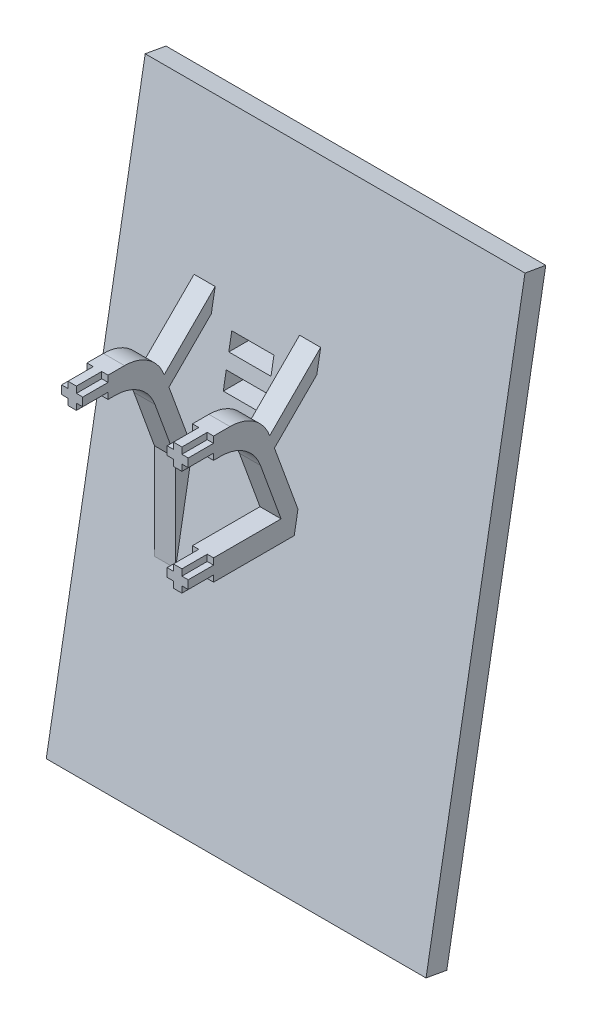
ISO-10303-21;
HEADER;
FILE_DESCRIPTION(('STEP AP214'),'2;1');
FILE_NAME('part.step','',(''),(''),'','','');
FILE_SCHEMA(('AUTOMOTIVE_DESIGN { 1 0 10303 214 1 1 1 1 }'));
ENDSEC;
DATA;
#1=APPLICATION_CONTEXT('core data for automotive mechanical design processes');
#2=APPLICATION_PROTOCOL_DEFINITION('international standard','automotive_design',2000,#1);
#3=PRODUCT_CONTEXT('',#1,'mechanical');
#4=PRODUCT('Part','Part','',(#3));
#5=PRODUCT_RELATED_PRODUCT_CATEGORY('part','',(#4));
#6=PRODUCT_DEFINITION_FORMATION('','',#4);
#7=PRODUCT_DEFINITION_CONTEXT('part definition',#1,'design');
#8=PRODUCT_DEFINITION('design','',#6,#7);
#9=PRODUCT_DEFINITION_SHAPE('','',#8);
#10=(LENGTH_UNIT() NAMED_UNIT(*) SI_UNIT(.MILLI.,.METRE.));
#11=(NAMED_UNIT(*) PLANE_ANGLE_UNIT() SI_UNIT($,.RADIAN.));
#12=(NAMED_UNIT(*) SI_UNIT($,.STERADIAN.) SOLID_ANGLE_UNIT());
#13=UNCERTAINTY_MEASURE_WITH_UNIT(LENGTH_MEASURE(1.E-05),#10,'distance_accuracy_value','');
#14=(GEOMETRIC_REPRESENTATION_CONTEXT(3) GLOBAL_UNCERTAINTY_ASSIGNED_CONTEXT((#13)) GLOBAL_UNIT_ASSIGNED_CONTEXT((#10,
#11,#12)) REPRESENTATION_CONTEXT('',''));
#15=CARTESIAN_POINT('',(0.,0.,0.));
#16=DIRECTION('',(0.,0.,1.));
#17=DIRECTION('',(1.,0.,0.));
#18=AXIS2_PLACEMENT_3D('',#15,#16,#17);
#19=CARTESIAN_POINT('',(0.,0.0753842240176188,0.427525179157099));
#20=DIRECTION('',(0.,0.173648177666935,0.984807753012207));
#21=DIRECTION('',(0.,-0.984807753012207,0.173648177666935));
#22=AXIS2_PLACEMENT_3D('',#19,#20,#21);
#23=PLANE('',#22);
#24=DIRECTION('',(0.,-0.984807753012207,0.173648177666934));
#25=VECTOR('',#24,1.);
#26=CARTESIAN_POINT('',(-27.5,-20.1851272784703,4.00000000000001));
#27=LINE('',#26,#25);
#28=CARTESIAN_POINT('',(-27.5,2.5,0.));
#29=VERTEX_POINT('',#28);
#30=CARTESIAN_POINT('',(-27.5,-20.1851272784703,4.00000000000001));
#31=VERTEX_POINT('',#30);
#32=EDGE_CURVE('E857',#29,#31,#27,.T.);
#33=ORIENTED_EDGE('',*,*,#32,.F.);
#34=DIRECTION('',(1.,0.,0.));
#35=VECTOR('',#34,1.);
#36=CARTESIAN_POINT('',(-27.5,2.5,0.));
#37=LINE('',#36,#35);
#38=CARTESIAN_POINT('',(-22.5,2.5,0.));
#39=VERTEX_POINT('',#38);
#40=EDGE_CURVE('E879',#29,#39,#37,.T.);
#41=ORIENTED_EDGE('',*,*,#40,.T.);
#42=DIRECTION('',(0.,-0.984807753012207,0.173648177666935));
#43=VECTOR('',#42,1.);
#44=CARTESIAN_POINT('',(-22.5,2.5,0.));
#45=LINE('',#44,#43);
#46=CARTESIAN_POINT('',(-22.5,-20.1851272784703,4.00000000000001));
#47=VERTEX_POINT('',#46);
#48=EDGE_CURVE('E861',#39,#47,#45,.T.);
#49=ORIENTED_EDGE('',*,*,#48,.T.);
#50=DIRECTION('',(1.,0.,0.));
#51=VECTOR('',#50,1.);
#52=CARTESIAN_POINT('',(-27.5,-20.1851272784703,4.00000000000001));
#53=LINE('',#52,#51);
#54=EDGE_CURVE('E923',#31,#47,#53,.T.);
#55=ORIENTED_EDGE('',*,*,#54,.F.);
#56=EDGE_LOOP('',(#33,#41,#49,#55));
#57=FACE_BOUND('',#56,.T.);
#58=DIRECTION('',(0.,-0.984807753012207,0.173648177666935));
#59=VECTOR('',#58,1.);
#60=CARTESIAN_POINT('',(45.,66.5499075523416,-11.293726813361));
#61=LINE('',#60,#59);
#62=CARTESIAN_POINT('',(45.,66.5499075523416,-11.293726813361));
#63=VERTEX_POINT('',#62);
#64=CARTESIAN_POINT('',(45.,-66.3991391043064,12.1487771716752));
#65=VERTEX_POINT('',#64);
#66=EDGE_CURVE('E1073',#63,#65,#61,.T.);
#67=ORIENTED_EDGE('',*,*,#66,.F.);
#68=DIRECTION('',(1.,0.,0.));
#69=VECTOR('',#68,1.);
#70=CARTESIAN_POINT('',(-45.,66.5499075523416,-11.293726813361));
#71=LINE('',#70,#69);
#72=CARTESIAN_POINT('',(-45.,66.5499075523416,-11.293726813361));
#73=VERTEX_POINT('',#72);
#74=EDGE_CURVE('E1078',#73,#63,#71,.T.);
#75=ORIENTED_EDGE('',*,*,#74,.F.);
#76=DIRECTION('',(0.,0.984807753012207,-0.173648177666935));
#77=VECTOR('',#76,1.);
#78=CARTESIAN_POINT('',(-45.,66.5499075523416,-11.293726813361));
#79=LINE('',#78,#77);
#80=CARTESIAN_POINT('',(-45.,-66.3991391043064,12.1487771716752));
#81=VERTEX_POINT('',#80);
#82=EDGE_CURVE('E1089',#81,#73,#79,.T.);
#83=ORIENTED_EDGE('',*,*,#82,.F.);
#84=DIRECTION('',(-1.,0.,0.));
#85=VECTOR('',#84,1.);
#86=CARTESIAN_POINT('',(-45.,-66.3991391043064,12.1487771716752));
#87=LINE('',#86,#85);
#88=EDGE_CURVE('E1087',#65,#81,#87,.T.);
#89=ORIENTED_EDGE('',*,*,#88,.F.);
#90=EDGE_LOOP('',(#67,#75,#83,#89));
#91=FACE_BOUND('',#90,.T.);
#92=DIRECTION('',(0.,-0.984807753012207,0.173648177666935));
#93=VECTOR('',#92,1.);
#94=CARTESIAN_POINT('',(-2.5,-1.9462618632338,0.783995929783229));
#95=LINE('',#94,#93);
#96=CARTESIAN_POINT('',(-2.5,2.5,0.));
#97=VERTEX_POINT('',#96);
#98=CARTESIAN_POINT('',(-2.5,-2.5,0.881634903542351));
#99=VERTEX_POINT('',#98);
#100=EDGE_CURVE('E1109',#97,#99,#95,.T.);
#101=ORIENTED_EDGE('',*,*,#100,.F.);
#102=DIRECTION('',(-1.,0.,0.));
#103=VECTOR('',#102,1.);
#104=CARTESIAN_POINT('',(2.5,2.5,0.));
#105=LINE('',#104,#103);
#106=CARTESIAN_POINT('',(2.5,2.5,0.));
#107=VERTEX_POINT('',#106);
#108=EDGE_CURVE('E1112',#107,#97,#105,.T.);
#109=ORIENTED_EDGE('',*,*,#108,.F.);
#110=DIRECTION('',(0.,-0.984807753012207,0.173648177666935));
#111=VECTOR('',#110,1.);
#112=CARTESIAN_POINT('',(2.5,2.5,0.));
#113=LINE('',#112,#111);
#114=CARTESIAN_POINT('',(2.5,-2.5,0.88163490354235));
#115=VERTEX_POINT('',#114);
#116=EDGE_CURVE('E1103',#107,#115,#113,.T.);
#117=ORIENTED_EDGE('',*,*,#116,.T.);
#118=DIRECTION('',(1.,0.,0.));
#119=VECTOR('',#118,1.);
#120=CARTESIAN_POINT('',(-17.5,-2.5,0.881634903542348));
#121=LINE('',#120,#119);
#122=EDGE_CURVE('E1106',#99,#115,#121,.T.);
#123=ORIENTED_EDGE('',*,*,#122,.F.);
#124=EDGE_LOOP('',(#101,#109,#117,#123));
#125=FACE_BOUND('',#124,.T.);
#126=DIRECTION('',(-1.,0.,0.));
#127=VECTOR('',#126,1.);
#128=CARTESIAN_POINT('',(-22.5,33.0031315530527,-5.37852508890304));
#129=LINE('',#128,#127);
#130=CARTESIAN_POINT('',(-22.5,33.0031315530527,-5.37852508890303));
#131=VERTEX_POINT('',#130);
#132=CARTESIAN_POINT('',(-27.5,33.0031315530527,-5.37852508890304));
#133=VERTEX_POINT('',#132);
#134=EDGE_CURVE('E659',#131,#133,#129,.T.);
#135=ORIENTED_EDGE('',*,*,#134,.F.);
#136=DIRECTION('',(0.,-0.984807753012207,0.173648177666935));
#137=VECTOR('',#136,1.);
#138=CARTESIAN_POINT('',(-22.5,33.0031315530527,-5.37852508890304));
#139=LINE('',#138,#137);
#140=CARTESIAN_POINT('',(-22.5,27.8522517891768,-4.47028601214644));
#141=VERTEX_POINT('',#140);
#142=EDGE_CURVE('E653',#131,#141,#139,.T.);
#143=ORIENTED_EDGE('',*,*,#142,.T.);
#144=DIRECTION('',(-1.,0.,0.));
#145=VECTOR('',#144,1.);
#146=CARTESIAN_POINT('',(-22.5,27.8522517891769,-4.47028601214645));
#147=LINE('',#146,#145);
#148=CARTESIAN_POINT('',(-27.5,27.8522517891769,-4.47028601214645));
#149=VERTEX_POINT('',#148);
#150=EDGE_CURVE('E671',#141,#149,#147,.T.);
#151=ORIENTED_EDGE('',*,*,#150,.T.);
#152=DIRECTION('',(0.,-0.984807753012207,0.173648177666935));
#153=VECTOR('',#152,1.);
#154=CARTESIAN_POINT('',(-27.5,33.0031315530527,-5.37852508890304));
#155=LINE('',#154,#153);
#156=EDGE_CURVE('E662',#133,#149,#155,.T.);
#157=ORIENTED_EDGE('',*,*,#156,.F.);
#158=EDGE_LOOP('',(#135,#143,#151,#157));
#159=FACE_BOUND('',#158,.T.);
#160=DIRECTION('',(-1.,0.,0.));
#161=VECTOR('',#160,1.);
#162=CARTESIAN_POINT('',(2.49999999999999,33.0031315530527,-5.37852508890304));
#163=LINE('',#162,#161);
#164=CARTESIAN_POINT('',(2.49999999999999,33.0031315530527,-5.37852508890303));
#165=VERTEX_POINT('',#164);
#166=CARTESIAN_POINT('',(-2.5,33.0031315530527,-5.37852508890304));
#167=VERTEX_POINT('',#166);
#168=EDGE_CURVE('E635',#165,#167,#163,.T.);
#169=ORIENTED_EDGE('',*,*,#168,.F.);
#170=DIRECTION('',(0.,-0.984807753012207,0.173648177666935));
#171=VECTOR('',#170,1.);
#172=CARTESIAN_POINT('',(2.49999999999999,33.0031315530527,-5.37852508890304));
#173=LINE('',#172,#171);
#174=CARTESIAN_POINT('',(2.5,27.8522517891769,-4.47028601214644));
#175=VERTEX_POINT('',#174);
#176=EDGE_CURVE('E630',#165,#175,#173,.T.);
#177=ORIENTED_EDGE('',*,*,#176,.T.);
#178=DIRECTION('',(-1.,0.,0.));
#179=VECTOR('',#178,1.);
#180=CARTESIAN_POINT('',(2.49999999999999,27.8522517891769,-4.47028601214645));
#181=LINE('',#180,#179);
#182=CARTESIAN_POINT('',(-2.50000000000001,27.8522517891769,-4.47028601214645));
#183=VERTEX_POINT('',#182);
#184=EDGE_CURVE('E646',#175,#183,#181,.T.);
#185=ORIENTED_EDGE('',*,*,#184,.T.);
#186=DIRECTION('',(0.,-0.984807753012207,0.173648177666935));
#187=VECTOR('',#186,1.);
#188=CARTESIAN_POINT('',(-2.50000000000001,33.0031315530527,-5.37852508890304));
#189=LINE('',#188,#187);
#190=EDGE_CURVE('E638',#167,#183,#189,.T.);
#191=ORIENTED_EDGE('',*,*,#190,.F.);
#192=EDGE_LOOP('',(#169,#177,#185,#191));
#193=FACE_BOUND('',#192,.T.);
#194=DIRECTION('',(1.,0.,0.));
#195=VECTOR('',#194,1.);
#196=CARTESIAN_POINT('',(-17.5,8.18166666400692,-1.0018311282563));
#197=LINE('',#196,#195);
#198=CARTESIAN_POINT('',(-17.5,8.18166666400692,-1.0018311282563));
#199=VERTEX_POINT('',#198);
#200=CARTESIAN_POINT('',(-7.49999999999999,8.18166666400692,-1.0018311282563));
#201=VERTEX_POINT('',#200);
#202=EDGE_CURVE('E615',#199,#201,#197,.T.);
#203=ORIENTED_EDGE('',*,*,#202,.F.);
#204=DIRECTION('',(0.,-0.984807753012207,0.173648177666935));
#205=VECTOR('',#204,1.);
#206=CARTESIAN_POINT('',(-17.5,0.0753842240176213,0.427525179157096));
#207=LINE('',#206,#205);
#208=CARTESIAN_POINT('',(-17.5,12.1816666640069,-1.70713905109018));
#209=VERTEX_POINT('',#208);
#210=EDGE_CURVE('E603',#209,#199,#207,.T.);
#211=ORIENTED_EDGE('',*,*,#210,.F.);
#212=DIRECTION('',(1.,0.,0.));
#213=VECTOR('',#212,1.);
#214=CARTESIAN_POINT('',(-17.5,12.1816666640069,-1.70713905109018));
#215=LINE('',#214,#213);
#216=CARTESIAN_POINT('',(-7.49999999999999,12.1816666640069,-1.70713905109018));
#217=VERTEX_POINT('',#216);
#218=EDGE_CURVE('E619',#209,#217,#215,.T.);
#219=ORIENTED_EDGE('',*,*,#218,.T.);
#220=DIRECTION('',(0.,-0.984807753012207,0.173648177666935));
#221=VECTOR('',#220,1.);
#222=CARTESIAN_POINT('',(-7.49999999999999,0.0753842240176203,0.427525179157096));
#223=LINE('',#222,#221);
#224=EDGE_CURVE('E597',#217,#201,#223,.T.);
#225=ORIENTED_EDGE('',*,*,#224,.T.);
#226=EDGE_LOOP('',(#203,#211,#219,#225));
#227=FACE_BOUND('',#226,.T.);
#228=DIRECTION('',(1.,0.,0.));
#229=VECTOR('',#228,1.);
#230=CARTESIAN_POINT('',(-17.5,22.95378295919,-3.60655379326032));
#231=LINE('',#230,#229);
#232=CARTESIAN_POINT('',(-17.5,22.95378295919,-3.60655379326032));
#233=VERTEX_POINT('',#232);
#234=CARTESIAN_POINT('',(-7.49999999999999,22.95378295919,-3.60655379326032));
#235=VERTEX_POINT('',#234);
#236=EDGE_CURVE('E551',#233,#235,#231,.T.);
#237=ORIENTED_EDGE('',*,*,#236,.F.);
#238=DIRECTION('',(0.,-0.984807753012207,0.173648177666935));
#239=VECTOR('',#238,1.);
#240=CARTESIAN_POINT('',(-17.5,14.8475005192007,-2.17719748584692));
#241=LINE('',#240,#239);
#242=CARTESIAN_POINT('',(-17.5,26.95378295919,-4.3118617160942));
#243=VERTEX_POINT('',#242);
#244=EDGE_CURVE('E573',#243,#233,#241,.T.);
#245=ORIENTED_EDGE('',*,*,#244,.F.);
#246=DIRECTION('',(1.,0.,0.));
#247=VECTOR('',#246,1.);
#248=CARTESIAN_POINT('',(-17.5,26.95378295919,-4.3118617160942));
#249=LINE('',#248,#247);
#250=CARTESIAN_POINT('',(-7.49999999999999,26.95378295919,-4.3118617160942));
#251=VERTEX_POINT('',#250);
#252=EDGE_CURVE('E586',#243,#251,#249,.T.);
#253=ORIENTED_EDGE('',*,*,#252,.T.);
#254=DIRECTION('',(0.,-0.984807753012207,0.173648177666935));
#255=VECTOR('',#254,1.);
#256=CARTESIAN_POINT('',(-7.49999999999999,14.8475005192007,-2.17719748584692));
#257=LINE('',#256,#255);
#258=EDGE_CURVE('E567',#251,#235,#257,.T.);
#259=ORIENTED_EDGE('',*,*,#258,.T.);
#260=EDGE_LOOP('',(#237,#245,#253,#259));
#261=FACE_BOUND('',#260,.T.);
#262=DIRECTION('',(1.,0.,0.));
#263=VECTOR('',#262,1.);
#264=CARTESIAN_POINT('',(-17.5,15.5677248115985,-2.30419246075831));
#265=LINE('',#264,#263);
#266=CARTESIAN_POINT('',(-17.5,15.5677248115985,-2.30419246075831));
#267=VERTEX_POINT('',#266);
#268=CARTESIAN_POINT('',(-7.49999999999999,15.5677248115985,-2.30419246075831));
#269=VERTEX_POINT('',#268);
#270=EDGE_CURVE('E557',#267,#269,#265,.T.);
#271=ORIENTED_EDGE('',*,*,#270,.F.);
#272=DIRECTION('',(0.,-0.984807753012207,0.173648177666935));
#273=VECTOR('',#272,1.);
#274=CARTESIAN_POINT('',(-17.5,7.46144237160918,-0.874836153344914));
#275=LINE('',#274,#273);
#276=CARTESIAN_POINT('',(-17.5,19.5677248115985,-3.00950038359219));
#277=VERTEX_POINT('',#276);
#278=EDGE_CURVE('E530',#277,#267,#275,.T.);
#279=ORIENTED_EDGE('',*,*,#278,.F.);
#280=DIRECTION('',(1.,0.,0.));
#281=VECTOR('',#280,1.);
#282=CARTESIAN_POINT('',(-17.5,19.5677248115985,-3.00950038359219));
#283=LINE('',#282,#281);
#284=CARTESIAN_POINT('',(-7.49999999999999,19.5677248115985,-3.00950038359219));
#285=VERTEX_POINT('',#284);
#286=EDGE_CURVE('E560',#277,#285,#283,.T.);
#287=ORIENTED_EDGE('',*,*,#286,.T.);
#288=DIRECTION('',(0.,-0.984807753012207,0.173648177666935));
#289=VECTOR('',#288,1.);
#290=CARTESIAN_POINT('',(-7.49999999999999,7.46144237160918,-0.874836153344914));
#291=LINE('',#290,#289);
#292=EDGE_CURVE('E540',#285,#269,#291,.T.);
#293=ORIENTED_EDGE('',*,*,#292,.T.);
#294=EDGE_LOOP('',(#271,#279,#287,#293));
#295=FACE_BOUND('',#294,.T.);
#296=ADVANCED_FACE('F36',(#57,#91,#125,#159,#193,#227,#261,#295),#23,.T.);
#297=CARTESIAN_POINT('',(0.,-0.792856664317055,-4.49651358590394));
#298=DIRECTION('',(0.,0.173648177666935,0.984807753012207));
#299=DIRECTION('',(0.,-0.984807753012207,0.173648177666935));
#300=AXIS2_PLACEMENT_3D('',#297,#298,#299);
#301=PLANE('',#300);
#302=DIRECTION('',(0.,0.984807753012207,-0.173648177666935));
#303=VECTOR('',#302,1.);
#304=CARTESIAN_POINT('',(-17.5,13.9792596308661,-7.10123625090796));
#305=LINE('',#304,#303);
#306=CARTESIAN_POINT('',(-17.5,22.95378295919,-8.68368685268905));
#307=VERTEX_POINT('',#306);
#308=CARTESIAN_POINT('',(-17.5,26.95378295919,-9.38899477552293));
#309=VERTEX_POINT('',#308);
#310=EDGE_CURVE('E566',#307,#309,#305,.T.);
#311=ORIENTED_EDGE('',*,*,#310,.F.);
#312=DIRECTION('',(1.,0.,0.));
#313=VECTOR('',#312,1.);
#314=CARTESIAN_POINT('',(-17.5,22.95378295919,-8.68368685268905));
#315=LINE('',#314,#313);
#316=CARTESIAN_POINT('',(-7.49999999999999,22.95378295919,-8.68368685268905));
#317=VERTEX_POINT('',#316);
#318=EDGE_CURVE('E576',#307,#317,#315,.T.);
#319=ORIENTED_EDGE('',*,*,#318,.T.);
#320=DIRECTION('',(0.,0.984807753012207,-0.173648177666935));
#321=VECTOR('',#320,1.);
#322=CARTESIAN_POINT('',(-7.49999999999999,13.9792596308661,-7.10123625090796));
#323=LINE('',#322,#321);
#324=CARTESIAN_POINT('',(-7.49999999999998,26.95378295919,-9.38899477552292));
#325=VERTEX_POINT('',#324);
#326=EDGE_CURVE('E578',#317,#325,#323,.T.);
#327=ORIENTED_EDGE('',*,*,#326,.T.);
#328=DIRECTION('',(1.,0.,0.));
#329=VECTOR('',#328,1.);
#330=CARTESIAN_POINT('',(-17.5,26.95378295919,-9.38899477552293));
#331=LINE('',#330,#329);
#332=EDGE_CURVE('E589',#309,#325,#331,.T.);
#333=ORIENTED_EDGE('',*,*,#332,.F.);
#334=EDGE_LOOP('',(#311,#319,#327,#333));
#335=FACE_BOUND('',#334,.T.);
#336=DIRECTION('',(0.,-0.984807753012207,0.173648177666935));
#337=VECTOR('',#336,1.);
#338=CARTESIAN_POINT('',(45.,65.6816666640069,-16.217765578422));
#339=LINE('',#338,#337);
#340=CARTESIAN_POINT('',(45.,65.6816666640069,-16.217765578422));
#341=VERTEX_POINT('',#340);
#342=CARTESIAN_POINT('',(45.,-67.2673799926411,7.22473840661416));
#343=VERTEX_POINT('',#342);
#344=EDGE_CURVE('E1074',#341,#343,#339,.T.);
#345=ORIENTED_EDGE('',*,*,#344,.T.);
#346=DIRECTION('',(-1.,0.,0.));
#347=VECTOR('',#346,1.);
#348=CARTESIAN_POINT('',(-45.,-67.2673799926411,7.22473840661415));
#349=LINE('',#348,#347);
#350=CARTESIAN_POINT('',(-45.,-67.2673799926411,7.22473840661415));
#351=VERTEX_POINT('',#350);
#352=EDGE_CURVE('E1077',#343,#351,#349,.T.);
#353=ORIENTED_EDGE('',*,*,#352,.T.);
#354=DIRECTION('',(0.,0.984807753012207,-0.173648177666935));
#355=VECTOR('',#354,1.);
#356=CARTESIAN_POINT('',(-45.,65.6816666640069,-16.217765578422));
#357=LINE('',#356,#355);
#358=CARTESIAN_POINT('',(-45.,65.6816666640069,-16.217765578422));
#359=VERTEX_POINT('',#358);
#360=EDGE_CURVE('E1080',#351,#359,#357,.T.);
#361=ORIENTED_EDGE('',*,*,#360,.T.);
#362=DIRECTION('',(1.,0.,0.));
#363=VECTOR('',#362,1.);
#364=CARTESIAN_POINT('',(-45.,65.6816666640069,-16.217765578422));
#365=LINE('',#364,#363);
#366=EDGE_CURVE('E1082',#359,#341,#365,.T.);
#367=ORIENTED_EDGE('',*,*,#366,.T.);
#368=EDGE_LOOP('',(#345,#353,#361,#367));
#369=FACE_BOUND('',#368,.T.);
#370=DIRECTION('',(0.,0.984807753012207,-0.173648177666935));
#371=VECTOR('',#370,1.);
#372=CARTESIAN_POINT('',(-17.5,-0.792856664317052,-4.49651358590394));
#373=LINE('',#372,#371);
#374=CARTESIAN_POINT('',(-17.5,8.18166666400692,-6.07896418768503));
#375=VERTEX_POINT('',#374);
#376=CARTESIAN_POINT('',(-17.5,12.1816666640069,-6.78427211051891));
#377=VERTEX_POINT('',#376);
#378=EDGE_CURVE('E596',#375,#377,#373,.T.);
#379=ORIENTED_EDGE('',*,*,#378,.F.);
#380=DIRECTION('',(1.,0.,0.));
#381=VECTOR('',#380,1.);
#382=CARTESIAN_POINT('',(-17.5,8.18166666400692,-6.07896418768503));
#383=LINE('',#382,#381);
#384=CARTESIAN_POINT('',(-7.49999999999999,8.18166666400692,-6.07896418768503));
#385=VERTEX_POINT('',#384);
#386=EDGE_CURVE('E606',#375,#385,#383,.T.);
#387=ORIENTED_EDGE('',*,*,#386,.T.);
#388=DIRECTION('',(0.,0.984807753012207,-0.173648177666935));
#389=VECTOR('',#388,1.);
#390=CARTESIAN_POINT('',(-7.49999999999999,-0.792856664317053,-4.49651358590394));
#391=LINE('',#390,#389);
#392=CARTESIAN_POINT('',(-7.49999999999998,12.1816666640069,-6.78427211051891));
#393=VERTEX_POINT('',#392);
#394=EDGE_CURVE('E608',#385,#393,#391,.T.);
#395=ORIENTED_EDGE('',*,*,#394,.T.);
#396=DIRECTION('',(1.,0.,0.));
#397=VECTOR('',#396,1.);
#398=CARTESIAN_POINT('',(-17.5,12.1816666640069,-6.78427211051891));
#399=LINE('',#398,#397);
#400=EDGE_CURVE('E622',#377,#393,#399,.T.);
#401=ORIENTED_EDGE('',*,*,#400,.F.);
#402=EDGE_LOOP('',(#379,#387,#395,#401));
#403=FACE_BOUND('',#402,.T.);
#404=DIRECTION('',(0.,0.984807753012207,-0.173648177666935));
#405=VECTOR('',#404,1.);
#406=CARTESIAN_POINT('',(-17.5,6.5932014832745,-5.79887491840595));
#407=LINE('',#406,#405);
#408=CARTESIAN_POINT('',(-17.5,15.5677248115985,-7.38132552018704));
#409=VERTEX_POINT('',#408);
#410=CARTESIAN_POINT('',(-17.5,19.5677248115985,-8.08663344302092));
#411=VERTEX_POINT('',#410);
#412=EDGE_CURVE('E536',#409,#411,#407,.T.);
#413=ORIENTED_EDGE('',*,*,#412,.F.);
#414=DIRECTION('',(1.,0.,0.));
#415=VECTOR('',#414,1.);
#416=CARTESIAN_POINT('',(-17.5,15.5677248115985,-7.38132552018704));
#417=LINE('',#416,#415);
#418=CARTESIAN_POINT('',(-7.49999999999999,15.5677248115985,-7.38132552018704));
#419=VERTEX_POINT('',#418);
#420=EDGE_CURVE('E521',#409,#419,#417,.T.);
#421=ORIENTED_EDGE('',*,*,#420,.T.);
#422=DIRECTION('',(0.,0.984807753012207,-0.173648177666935));
#423=VECTOR('',#422,1.);
#424=CARTESIAN_POINT('',(-7.49999999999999,6.5932014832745,-5.79887491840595));
#425=LINE('',#424,#423);
#426=CARTESIAN_POINT('',(-7.49999999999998,19.5677248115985,-8.08663344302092));
#427=VERTEX_POINT('',#426);
#428=EDGE_CURVE('E550',#419,#427,#425,.T.);
#429=ORIENTED_EDGE('',*,*,#428,.T.);
#430=DIRECTION('',(1.,0.,0.));
#431=VECTOR('',#430,1.);
#432=CARTESIAN_POINT('',(-17.5,19.5677248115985,-8.08663344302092));
#433=LINE('',#432,#431);
#434=EDGE_CURVE('E529',#411,#427,#433,.T.);
#435=ORIENTED_EDGE('',*,*,#434,.F.);
#436=EDGE_LOOP('',(#413,#421,#429,#435));
#437=FACE_BOUND('',#436,.T.);
#438=ADVANCED_FACE('F542',(#335,#369,#403,#437),#301,.F.);
#439=CARTESIAN_POINT('',(2.5,2.5,26.));
#440=DIRECTION('',(0.,-1.,0.));
#441=DIRECTION('',(1.,0.,0.));
#442=AXIS2_PLACEMENT_3D('',#439,#440,#441);
#443=PLANE('',#442);
#444=DIRECTION('',(-1.,0.,0.));
#445=VECTOR('',#444,1.);
#446=CARTESIAN_POINT('',(-2.5,2.49999999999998,20.));
#447=LINE('',#446,#445);
#448=CARTESIAN_POINT('',(-1.,2.49999999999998,20.));
#449=VERTEX_POINT('',#448);
#450=CARTESIAN_POINT('',(-2.5,2.49999999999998,20.));
#451=VERTEX_POINT('',#450);
#452=EDGE_CURVE('E779',#449,#451,#447,.T.);
#453=ORIENTED_EDGE('',*,*,#452,.F.);
#454=DIRECTION('',(0.,0.,1.));
#455=VECTOR('',#454,1.);
#456=CARTESIAN_POINT('',(-1.,2.49999999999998,20.));
#457=LINE('',#456,#455);
#458=CARTESIAN_POINT('',(-1.,2.49999999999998,26.));
#459=VERTEX_POINT('',#458);
#460=EDGE_CURVE('E760',#449,#459,#457,.T.);
#461=ORIENTED_EDGE('',*,*,#460,.T.);
#462=DIRECTION('',(-1.,0.,0.));
#463=VECTOR('',#462,1.);
#464=CARTESIAN_POINT('',(2.5,2.5,26.));
#465=LINE('',#464,#463);
#466=CARTESIAN_POINT('',(1.,2.5,26.));
#467=VERTEX_POINT('',#466);
#468=EDGE_CURVE('E1122',#467,#459,#465,.T.);
#469=ORIENTED_EDGE('',*,*,#468,.F.);
#470=DIRECTION('',(0.,0.,1.));
#471=VECTOR('',#470,1.);
#472=CARTESIAN_POINT('',(1.,2.49999999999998,20.));
#473=LINE('',#472,#471);
#474=CARTESIAN_POINT('',(1.,2.49999999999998,20.));
#475=VERTEX_POINT('',#474);
#476=EDGE_CURVE('E710',#475,#467,#473,.T.);
#477=ORIENTED_EDGE('',*,*,#476,.F.);
#478=DIRECTION('',(-1.,0.,0.));
#479=VECTOR('',#478,1.);
#480=CARTESIAN_POINT('',(2.5,2.49999999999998,20.));
#481=LINE('',#480,#479);
#482=CARTESIAN_POINT('',(2.5,2.49999999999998,20.));
#483=VERTEX_POINT('',#482);
#484=EDGE_CURVE('E700',#483,#475,#481,.T.);
#485=ORIENTED_EDGE('',*,*,#484,.F.);
#486=DIRECTION('',(0.,0.,-1.));
#487=VECTOR('',#486,1.);
#488=CARTESIAN_POINT('',(2.5,2.5,26.));
#489=LINE('',#488,#487);
#490=CARTESIAN_POINT('',(2.5,2.5,4.00000000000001));
#491=VERTEX_POINT('',#490);
#492=EDGE_CURVE('E1129',#483,#491,#489,.T.);
#493=ORIENTED_EDGE('',*,*,#492,.T.);
#494=DIRECTION('',(-1.,0.,0.));
#495=VECTOR('',#494,1.);
#496=CARTESIAN_POINT('',(2.5,2.5,4.));
#497=LINE('',#496,#495);
#498=CARTESIAN_POINT('',(-2.5,2.5,4.00000000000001));
#499=VERTEX_POINT('',#498);
#500=EDGE_CURVE('E1036',#491,#499,#497,.T.);
#501=ORIENTED_EDGE('',*,*,#500,.T.);
#502=DIRECTION('',(0.,0.,-1.));
#503=VECTOR('',#502,1.);
#504=CARTESIAN_POINT('',(-2.5,2.5,26.));
#505=LINE('',#504,#503);
#506=EDGE_CURVE('E1125',#451,#499,#505,.T.);
#507=ORIENTED_EDGE('',*,*,#506,.F.);
#508=EDGE_LOOP('',(#453,#461,#469,#477,#485,#493,#501,#507));
#509=FACE_BOUND('',#508,.T.);
#510=ADVANCED_FACE('F1219',(#509),#443,.F.);
#511=CARTESIAN_POINT('',(-2.5,2.5,26.));
#512=DIRECTION('',(1.,0.,0.));
#513=DIRECTION('',(0.,1.,0.));
#514=AXIS2_PLACEMENT_3D('',#511,#512,#513);
#515=PLANE('',#514);
#516=DIRECTION('',(0.,-1.,0.));
#517=VECTOR('',#516,1.);
#518=CARTESIAN_POINT('',(-2.5,2.5,26.));
#519=LINE('',#518,#517);
#520=CARTESIAN_POINT('',(-2.5,0.999999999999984,26.));
#521=VERTEX_POINT('',#520);
#522=CARTESIAN_POINT('',(-2.5,-1.00000000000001,26.));
#523=VERTEX_POINT('',#522);
#524=EDGE_CURVE('E1113',#521,#523,#519,.T.);
#525=ORIENTED_EDGE('',*,*,#524,.F.);
#526=DIRECTION('',(0.,0.,1.));
#527=VECTOR('',#526,1.);
#528=CARTESIAN_POINT('',(-2.5,0.999999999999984,20.));
#529=LINE('',#528,#527);
#530=CARTESIAN_POINT('',(-2.5,0.999999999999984,20.));
#531=VERTEX_POINT('',#530);
#532=EDGE_CURVE('E781',#531,#521,#529,.T.);
#533=ORIENTED_EDGE('',*,*,#532,.F.);
#534=DIRECTION('',(0.,-1.,0.));
#535=VECTOR('',#534,1.);
#536=CARTESIAN_POINT('',(-2.5,2.49999999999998,20.));
#537=LINE('',#536,#535);
#538=EDGE_CURVE('E769',#451,#531,#537,.T.);
#539=ORIENTED_EDGE('',*,*,#538,.F.);
#540=ORIENTED_EDGE('',*,*,#506,.T.);
#541=DIRECTION('',(0.,-0.939692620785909,-0.342020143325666));
#542=VECTOR('',#541,1.);
#543=CARTESIAN_POINT('',(-2.5,15.9202014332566,8.88455385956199));
#544=LINE('',#543,#542);
#545=CARTESIAN_POINT('',(-2.5,15.9202014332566,8.88455385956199));
#546=VERTEX_POINT('',#545);
#547=EDGE_CURVE('E1021',#546,#499,#544,.T.);
#548=ORIENTED_EDGE('',*,*,#547,.F.);
#549=CARTESIAN_POINT('',(-2.5,12.5,18.2814800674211));
#550=DIRECTION('',(-1.,0.,0.));
#551=DIRECTION('',(0.,0.,1.));
#552=AXIS2_PLACEMENT_3D('',#549,#550,#551);
#553=CIRCLE('',#552,10.);
#554=CARTESIAN_POINT('',(-2.5,22.5,18.2814800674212));
#555=VERTEX_POINT('',#554);
#556=EDGE_CURVE('E1049',#555,#546,#553,.T.);
#557=ORIENTED_EDGE('',*,*,#556,.F.);
#558=DIRECTION('',(0.,0.,-1.));
#559=VECTOR('',#558,1.);
#560=CARTESIAN_POINT('',(-2.5,22.5,26.));
#561=LINE('',#560,#559);
#562=CARTESIAN_POINT('',(-2.5,22.5,20.));
#563=VERTEX_POINT('',#562);
#564=EDGE_CURVE('E1047',#563,#555,#561,.T.);
#565=ORIENTED_EDGE('',*,*,#564,.F.);
#566=DIRECTION('',(0.,-1.,0.));
#567=VECTOR('',#566,1.);
#568=CARTESIAN_POINT('',(-2.5,22.5,20.));
#569=LINE('',#568,#567);
#570=CARTESIAN_POINT('',(-2.5,24.,20.));
#571=VERTEX_POINT('',#570);
#572=EDGE_CURVE('E973',#571,#563,#569,.T.);
#573=ORIENTED_EDGE('',*,*,#572,.F.);
#574=DIRECTION('',(0.,0.,1.));
#575=VECTOR('',#574,1.);
#576=CARTESIAN_POINT('',(-2.5,24.,20.));
#577=LINE('',#576,#575);
#578=CARTESIAN_POINT('',(-2.5,24.,26.));
#579=VERTEX_POINT('',#578);
#580=EDGE_CURVE('E964',#571,#579,#577,.T.);
#581=ORIENTED_EDGE('',*,*,#580,.T.);
#582=DIRECTION('',(0.,-1.,0.));
#583=VECTOR('',#582,1.);
#584=CARTESIAN_POINT('',(-2.5,27.5,26.));
#585=LINE('',#584,#583);
#586=CARTESIAN_POINT('',(-2.5,26.,26.));
#587=VERTEX_POINT('',#586);
#588=EDGE_CURVE('E1044',#587,#579,#585,.T.);
#589=ORIENTED_EDGE('',*,*,#588,.F.);
#590=DIRECTION('',(0.,0.,1.));
#591=VECTOR('',#590,1.);
#592=CARTESIAN_POINT('',(-2.5,26.,20.));
#593=LINE('',#592,#591);
#594=CARTESIAN_POINT('',(-2.5,26.,20.));
#595=VERTEX_POINT('',#594);
#596=EDGE_CURVE('E1006',#595,#587,#593,.T.);
#597=ORIENTED_EDGE('',*,*,#596,.F.);
#598=DIRECTION('',(0.,-1.,0.));
#599=VECTOR('',#598,1.);
#600=CARTESIAN_POINT('',(-2.5,27.5,20.));
#601=LINE('',#600,#599);
#602=CARTESIAN_POINT('',(-2.5,27.5,20.));
#603=VERTEX_POINT('',#602);
#604=EDGE_CURVE('E994',#603,#595,#601,.T.);
#605=ORIENTED_EDGE('',*,*,#604,.F.);
#606=DIRECTION('',(0.,0.,1.));
#607=VECTOR('',#606,1.);
#608=CARTESIAN_POINT('',(-2.5,27.5,16.1013312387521));
#609=LINE('',#608,#607);
#610=CARTESIAN_POINT('',(-2.5,27.5,16.1013312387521));
#611=VERTEX_POINT('',#610);
#612=EDGE_CURVE('E1041',#611,#603,#609,.T.);
#613=ORIENTED_EDGE('',*,*,#612,.F.);
#614=CARTESIAN_POINT('',(-2.5,17.5,16.1013312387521));
#615=DIRECTION('',(1.,0.,0.));
#616=DIRECTION('',(0.,0.,-1.));
#617=AXIS2_PLACEMENT_3D('',#614,#615,#616);
#618=CIRCLE('',#617,10.);
#619=CARTESIAN_POINT('',(-2.5,20.9202014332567,6.70440503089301));
#620=VERTEX_POINT('',#619);
#621=EDGE_CURVE('E1039',#620,#611,#618,.T.);
#622=ORIENTED_EDGE('',*,*,#621,.F.);
#623=DIRECTION('',(0.,0.707106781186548,-0.707106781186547));
#624=VECTOR('',#623,1.);
#625=CARTESIAN_POINT('',(-2.50000000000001,20.9202014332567,6.70440503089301));
#626=LINE('',#625,#624);
#627=EDGE_CURVE('E618',#620,#167,#626,.T.);
#628=ORIENTED_EDGE('',*,*,#627,.T.);
#629=ORIENTED_EDGE('',*,*,#190,.T.);
#630=DIRECTION('',(0.,-0.707106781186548,0.707106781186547));
#631=VECTOR('',#630,1.);
#632=CARTESIAN_POINT('',(-2.50000000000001,27.8522517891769,-4.47028601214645));
#633=LINE('',#632,#631);
#634=CARTESIAN_POINT('',(-2.5,17.8096931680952,5.57227260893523));
#635=VERTEX_POINT('',#634);
#636=EDGE_CURVE('E631',#183,#635,#633,.T.);
#637=ORIENTED_EDGE('',*,*,#636,.T.);
#638=DIRECTION('',(0.,0.939692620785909,0.342020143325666));
#639=VECTOR('',#638,1.);
#640=CARTESIAN_POINT('',(-2.5,2.5,0.));
#641=LINE('',#640,#639);
#642=EDGE_CURVE('E1013',#97,#635,#641,.T.);
#643=ORIENTED_EDGE('',*,*,#642,.F.);
#644=ORIENTED_EDGE('',*,*,#100,.T.);
#645=DIRECTION('',(0.,0.,-1.));
#646=VECTOR('',#645,1.);
#647=CARTESIAN_POINT('',(-2.5,-2.5,26.));
#648=LINE('',#647,#646);
#649=CARTESIAN_POINT('',(-2.5,-2.50000000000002,20.));
#650=VERTEX_POINT('',#649);
#651=EDGE_CURVE('E11',#650,#99,#648,.T.);
#652=ORIENTED_EDGE('',*,*,#651,.F.);
#653=DIRECTION('',(0.,-1.,0.));
#654=VECTOR('',#653,1.);
#655=CARTESIAN_POINT('',(-2.5,-2.50000000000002,20.));
#656=LINE('',#655,#654);
#657=CARTESIAN_POINT('',(-2.5,-1.00000000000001,20.));
#658=VERTEX_POINT('',#657);
#659=EDGE_CURVE('E723',#658,#650,#656,.T.);
#660=ORIENTED_EDGE('',*,*,#659,.F.);
#661=DIRECTION('',(0.,0.,1.));
#662=VECTOR('',#661,1.);
#663=CARTESIAN_POINT('',(-2.5,-1.00000000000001,20.));
#664=LINE('',#663,#662);
#665=EDGE_CURVE('E714',#658,#523,#664,.T.);
#666=ORIENTED_EDGE('',*,*,#665,.T.);
#667=EDGE_LOOP('',(#525,#533,#539,#540,#548,#557,#565,#573,#581,#589,#597,#605,#613,#622,#628,
#629,#637,#643,#644,#652,#660,#666));
#668=FACE_BOUND('',#667,.T.);
#669=ADVANCED_FACE('F38',(#668),#515,.F.);
#670=CARTESIAN_POINT('',(2.5,-2.5,26.));
#671=DIRECTION('',(0.,1.,0.));
#672=DIRECTION('',(-1.,0.,0.));
#673=AXIS2_PLACEMENT_3D('',#670,#671,#672);
#674=PLANE('',#673);
#675=DIRECTION('',(1.,0.,0.));
#676=VECTOR('',#675,1.);
#677=CARTESIAN_POINT('',(2.5,-2.50000000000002,20.));
#678=LINE('',#677,#676);
#679=CARTESIAN_POINT('',(1.,-2.50000000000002,20.));
#680=VERTEX_POINT('',#679);
#681=CARTESIAN_POINT('',(2.5,-2.50000000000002,20.));
#682=VERTEX_POINT('',#681);
#683=EDGE_CURVE('E685',#680,#682,#678,.T.);
#684=ORIENTED_EDGE('',*,*,#683,.F.);
#685=DIRECTION('',(0.,0.,1.));
#686=VECTOR('',#685,1.);
#687=CARTESIAN_POINT('',(1.,-2.50000000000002,20.));
#688=LINE('',#687,#686);
#689=CARTESIAN_POINT('',(1.,-2.50000000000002,26.));
#690=VERTEX_POINT('',#689);
#691=EDGE_CURVE('E691',#680,#690,#688,.T.);
#692=ORIENTED_EDGE('',*,*,#691,.T.);
#693=DIRECTION('',(1.,0.,0.));
#694=VECTOR('',#693,1.);
#695=CARTESIAN_POINT('',(2.5,-2.5,26.));
#696=LINE('',#695,#694);
#697=CARTESIAN_POINT('',(-1.,-2.5,26.));
#698=VERTEX_POINT('',#697);
#699=EDGE_CURVE('E1116',#698,#690,#696,.T.);
#700=ORIENTED_EDGE('',*,*,#699,.F.);
#701=DIRECTION('',(0.,0.,1.));
#702=VECTOR('',#701,1.);
#703=CARTESIAN_POINT('',(-1.,-2.50000000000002,20.));
#704=LINE('',#703,#702);
#705=CARTESIAN_POINT('',(-1.,-2.50000000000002,20.));
#706=VERTEX_POINT('',#705);
#707=EDGE_CURVE('E735',#706,#698,#704,.T.);
#708=ORIENTED_EDGE('',*,*,#707,.F.);
#709=DIRECTION('',(1.,0.,0.));
#710=VECTOR('',#709,1.);
#711=CARTESIAN_POINT('',(-2.5,-2.50000000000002,20.));
#712=LINE('',#711,#710);
#713=EDGE_CURVE('E725',#650,#706,#712,.T.);
#714=ORIENTED_EDGE('',*,*,#713,.F.);
#715=ORIENTED_EDGE('',*,*,#651,.T.);
#716=ORIENTED_EDGE('',*,*,#122,.T.);
#717=DIRECTION('',(0.,0.,-1.));
#718=VECTOR('',#717,1.);
#719=CARTESIAN_POINT('',(2.5,-2.5,26.));
#720=LINE('',#719,#718);
#721=EDGE_CURVE('E44',#682,#115,#720,.T.);
#722=ORIENTED_EDGE('',*,*,#721,.F.);
#723=EDGE_LOOP('',(#684,#692,#700,#708,#714,#715,#716,#722));
#724=FACE_BOUND('',#723,.T.);
#725=ADVANCED_FACE('F1143',(#724),#674,.F.);
#726=CARTESIAN_POINT('',(2.5,2.5,26.));
#727=DIRECTION('',(-1.,0.,0.));
#728=DIRECTION('',(0.,-1.,0.));
#729=AXIS2_PLACEMENT_3D('',#726,#727,#728);
#730=PLANE('',#729);
#731=DIRECTION('',(0.,1.,0.));
#732=VECTOR('',#731,1.);
#733=CARTESIAN_POINT('',(2.5,2.5,26.));
#734=LINE('',#733,#732);
#735=CARTESIAN_POINT('',(2.5,-1.00000000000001,26.));
#736=VERTEX_POINT('',#735);
#737=CARTESIAN_POINT('',(2.5,0.999999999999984,26.));
#738=VERTEX_POINT('',#737);
#739=EDGE_CURVE('E1119',#736,#738,#734,.T.);
#740=ORIENTED_EDGE('',*,*,#739,.F.);
#741=DIRECTION('',(0.,0.,1.));
#742=VECTOR('',#741,1.);
#743=CARTESIAN_POINT('',(2.5,-1.00000000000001,20.));
#744=LINE('',#743,#742);
#745=CARTESIAN_POINT('',(2.5,-1.00000000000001,20.));
#746=VERTEX_POINT('',#745);
#747=EDGE_CURVE('E687',#746,#736,#744,.T.);
#748=ORIENTED_EDGE('',*,*,#747,.F.);
#749=DIRECTION('',(0.,1.,0.));
#750=VECTOR('',#749,1.);
#751=CARTESIAN_POINT('',(2.5,-2.50000000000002,20.));
#752=LINE('',#751,#750);
#753=EDGE_CURVE('E675',#682,#746,#752,.T.);
#754=ORIENTED_EDGE('',*,*,#753,.F.);
#755=ORIENTED_EDGE('',*,*,#721,.T.);
#756=ORIENTED_EDGE('',*,*,#116,.F.);
#757=DIRECTION('',(0.,0.939692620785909,0.342020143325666));
#758=VECTOR('',#757,1.);
#759=CARTESIAN_POINT('',(2.5,2.5,0.));
#760=LINE('',#759,#758);
#761=CARTESIAN_POINT('',(2.5,17.8096931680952,5.57227260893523));
#762=VERTEX_POINT('',#761);
#763=EDGE_CURVE('E1017',#107,#762,#760,.T.);
#764=ORIENTED_EDGE('',*,*,#763,.T.);
#765=DIRECTION('',(0.,-0.707106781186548,0.707106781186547));
#766=VECTOR('',#765,1.);
#767=CARTESIAN_POINT('',(2.49999999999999,27.8522517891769,-4.47028601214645));
#768=LINE('',#767,#766);
#769=EDGE_CURVE('E633',#175,#762,#768,.T.);
#770=ORIENTED_EDGE('',*,*,#769,.F.);
#771=ORIENTED_EDGE('',*,*,#176,.F.);
#772=DIRECTION('',(0.,0.707106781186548,-0.707106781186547));
#773=VECTOR('',#772,1.);
#774=CARTESIAN_POINT('',(2.49999999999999,20.9202014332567,6.70440503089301));
#775=LINE('',#774,#773);
#776=CARTESIAN_POINT('',(2.49999999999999,20.9202014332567,6.70440503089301));
#777=VERTEX_POINT('',#776);
#778=EDGE_CURVE('E627',#777,#165,#775,.T.);
#779=ORIENTED_EDGE('',*,*,#778,.F.);
#780=CARTESIAN_POINT('',(2.5,17.5,16.1013312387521));
#781=DIRECTION('',(1.,0.,0.));
#782=DIRECTION('',(0.,0.,-1.));
#783=AXIS2_PLACEMENT_3D('',#780,#781,#782);
#784=CIRCLE('',#783,10.);
#785=CARTESIAN_POINT('',(2.5,27.5,16.1013312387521));
#786=VERTEX_POINT('',#785);
#787=EDGE_CURVE('E1020',#777,#786,#784,.T.);
#788=ORIENTED_EDGE('',*,*,#787,.T.);
#789=DIRECTION('',(0.,0.,1.));
#790=VECTOR('',#789,1.);
#791=CARTESIAN_POINT('',(2.5,27.5,16.1013312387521));
#792=LINE('',#791,#790);
#793=CARTESIAN_POINT('',(2.5,27.5,20.));
#794=VERTEX_POINT('',#793);
#795=EDGE_CURVE('E1023',#786,#794,#792,.T.);
#796=ORIENTED_EDGE('',*,*,#795,.T.);
#797=DIRECTION('',(0.,1.,0.));
#798=VECTOR('',#797,1.);
#799=CARTESIAN_POINT('',(2.5,27.5,20.));
#800=LINE('',#799,#798);
#801=CARTESIAN_POINT('',(2.5,26.,20.));
#802=VERTEX_POINT('',#801);
#803=EDGE_CURVE('E948',#802,#794,#800,.T.);
#804=ORIENTED_EDGE('',*,*,#803,.F.);
#805=DIRECTION('',(0.,0.,1.));
#806=VECTOR('',#805,1.);
#807=CARTESIAN_POINT('',(2.5,26.,20.));
#808=LINE('',#807,#806);
#809=CARTESIAN_POINT('',(2.5,26.,26.));
#810=VERTEX_POINT('',#809);
#811=EDGE_CURVE('E966',#802,#810,#808,.T.);
#812=ORIENTED_EDGE('',*,*,#811,.T.);
#813=DIRECTION('',(0.,-1.,0.));
#814=VECTOR('',#813,1.);
#815=CARTESIAN_POINT('',(2.5,27.5,26.));
#816=LINE('',#815,#814);
#817=CARTESIAN_POINT('',(2.5,24.,26.));
#818=VERTEX_POINT('',#817);
#819=EDGE_CURVE('E1026',#810,#818,#816,.T.);
#820=ORIENTED_EDGE('',*,*,#819,.T.);
#821=DIRECTION('',(0.,0.,1.));
#822=VECTOR('',#821,1.);
#823=CARTESIAN_POINT('',(2.5,24.,20.));
#824=LINE('',#823,#822);
#825=CARTESIAN_POINT('',(2.5,24.,20.));
#826=VERTEX_POINT('',#825);
#827=EDGE_CURVE('E937',#826,#818,#824,.T.);
#828=ORIENTED_EDGE('',*,*,#827,.F.);
#829=DIRECTION('',(0.,1.,0.));
#830=VECTOR('',#829,1.);
#831=CARTESIAN_POINT('',(2.5,22.5,20.));
#832=LINE('',#831,#830);
#833=CARTESIAN_POINT('',(2.5,22.5,20.));
#834=VERTEX_POINT('',#833);
#835=EDGE_CURVE('E926',#834,#826,#832,.T.);
#836=ORIENTED_EDGE('',*,*,#835,.F.);
#837=DIRECTION('',(0.,0.,-1.));
#838=VECTOR('',#837,1.);
#839=CARTESIAN_POINT('',(2.5,22.5,26.));
#840=LINE('',#839,#838);
#841=CARTESIAN_POINT('',(2.5,22.5,18.2814800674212));
#842=VERTEX_POINT('',#841);
#843=EDGE_CURVE('E1029',#834,#842,#840,.T.);
#844=ORIENTED_EDGE('',*,*,#843,.T.);
#845=CARTESIAN_POINT('',(2.5,12.5,18.2814800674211));
#846=DIRECTION('',(-1.,0.,0.));
#847=DIRECTION('',(0.,0.,1.));
#848=AXIS2_PLACEMENT_3D('',#845,#846,#847);
#849=CIRCLE('',#848,10.);
#850=CARTESIAN_POINT('',(2.5,15.9202014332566,8.88455385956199));
#851=VERTEX_POINT('',#850);
#852=EDGE_CURVE('E1031',#842,#851,#849,.T.);
#853=ORIENTED_EDGE('',*,*,#852,.T.);
#854=DIRECTION('',(0.,-0.939692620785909,-0.342020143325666));
#855=VECTOR('',#854,1.);
#856=CARTESIAN_POINT('',(2.5,15.9202014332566,8.88455385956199));
#857=LINE('',#856,#855);
#858=EDGE_CURVE('E1033',#851,#491,#857,.T.);
#859=ORIENTED_EDGE('',*,*,#858,.T.);
#860=ORIENTED_EDGE('',*,*,#492,.F.);
#861=DIRECTION('',(0.,1.,0.));
#862=VECTOR('',#861,1.);
#863=CARTESIAN_POINT('',(2.5,2.49999999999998,20.));
#864=LINE('',#863,#862);
#865=CARTESIAN_POINT('',(2.5,0.999999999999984,20.));
#866=VERTEX_POINT('',#865);
#867=EDGE_CURVE('E698',#866,#483,#864,.T.);
#868=ORIENTED_EDGE('',*,*,#867,.F.);
#869=DIRECTION('',(0.,0.,1.));
#870=VECTOR('',#869,1.);
#871=CARTESIAN_POINT('',(2.5,0.999999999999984,20.));
#872=LINE('',#871,#870);
#873=EDGE_CURVE('E716',#866,#738,#872,.T.);
#874=ORIENTED_EDGE('',*,*,#873,.T.);
#875=EDGE_LOOP('',(#740,#748,#754,#755,#756,#764,#770,#771,#779,#788,#796,#804,#812,#820,#828,
#836,#844,#853,#859,#860,#868,#874));
#876=FACE_BOUND('',#875,.T.);
#877=ADVANCED_FACE('F1135',(#876),#730,.F.);
#878=CARTESIAN_POINT('',(0.,0.,26.));
#879=DIRECTION('',(0.,0.,-1.));
#880=DIRECTION('',(-1.,0.,0.));
#881=AXIS2_PLACEMENT_3D('',#878,#879,#880);
#882=PLANE('',#881);
#883=ORIENTED_EDGE('',*,*,#468,.T.);
#884=DIRECTION('',(0.,1.,0.));
#885=VECTOR('',#884,1.);
#886=CARTESIAN_POINT('',(-1.,2.49999999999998,26.));
#887=LINE('',#886,#885);
#888=CARTESIAN_POINT('',(-1.,0.999999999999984,26.));
#889=VERTEX_POINT('',#888);
#890=EDGE_CURVE('E773',#889,#459,#887,.T.);
#891=ORIENTED_EDGE('',*,*,#890,.F.);
#892=DIRECTION('',(1.,0.,0.));
#893=VECTOR('',#892,1.);
#894=CARTESIAN_POINT('',(-2.5,0.999999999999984,26.));
#895=LINE('',#894,#893);
#896=EDGE_CURVE('E719',#521,#889,#895,.T.);
#897=ORIENTED_EDGE('',*,*,#896,.F.);
#898=ORIENTED_EDGE('',*,*,#524,.T.);
#899=DIRECTION('',(-1.,0.,0.));
#900=VECTOR('',#899,1.);
#901=CARTESIAN_POINT('',(-2.5,-1.00000000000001,26.));
#902=LINE('',#901,#900);
#903=CARTESIAN_POINT('',(-1.,-1.00000000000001,26.));
#904=VERTEX_POINT('',#903);
#905=EDGE_CURVE('E726',#904,#523,#902,.T.);
#906=ORIENTED_EDGE('',*,*,#905,.F.);
#907=DIRECTION('',(0.,1.,0.));
#908=VECTOR('',#907,1.);
#909=CARTESIAN_POINT('',(-1.,-2.50000000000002,26.));
#910=LINE('',#909,#908);
#911=EDGE_CURVE('E694',#698,#904,#910,.T.);
#912=ORIENTED_EDGE('',*,*,#911,.F.);
#913=ORIENTED_EDGE('',*,*,#699,.T.);
#914=DIRECTION('',(0.,-1.,0.));
#915=VECTOR('',#914,1.);
#916=CARTESIAN_POINT('',(1.,-2.50000000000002,26.));
#917=LINE('',#916,#915);
#918=CARTESIAN_POINT('',(1.,-1.00000000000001,26.));
#919=VERTEX_POINT('',#918);
#920=EDGE_CURVE('E679',#919,#690,#917,.T.);
#921=ORIENTED_EDGE('',*,*,#920,.F.);
#922=DIRECTION('',(-1.,0.,0.));
#923=VECTOR('',#922,1.);
#924=CARTESIAN_POINT('',(2.5,-1.00000000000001,26.));
#925=LINE('',#924,#923);
#926=EDGE_CURVE('E670',#736,#919,#925,.T.);
#927=ORIENTED_EDGE('',*,*,#926,.F.);
#928=ORIENTED_EDGE('',*,*,#739,.T.);
#929=DIRECTION('',(1.,0.,0.));
#930=VECTOR('',#929,1.);
#931=CARTESIAN_POINT('',(2.5,0.999999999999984,26.));
#932=LINE('',#931,#930);
#933=CARTESIAN_POINT('',(1.,0.999999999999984,26.));
#934=VERTEX_POINT('',#933);
#935=EDGE_CURVE('E701',#934,#738,#932,.T.);
#936=ORIENTED_EDGE('',*,*,#935,.F.);
#937=DIRECTION('',(0.,-1.,0.));
#938=VECTOR('',#937,1.);
#939=CARTESIAN_POINT('',(1.,2.49999999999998,26.));
#940=LINE('',#939,#938);
#941=EDGE_CURVE('E711',#467,#934,#940,.T.);
#942=ORIENTED_EDGE('',*,*,#941,.F.);
#943=EDGE_LOOP('',(#883,#891,#897,#898,#906,#912,#913,#921,#927,#928,#936,#942));
#944=FACE_BOUND('',#943,.T.);
#945=ADVANCED_FACE('F1230',(#944),#882,.F.);
#946=CARTESIAN_POINT('',(45.,65.6816666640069,-16.217765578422));
#947=DIRECTION('',(-1.,0.,0.));
#948=DIRECTION('',(0.,-1.,0.));
#949=AXIS2_PLACEMENT_3D('',#946,#947,#948);
#950=PLANE('',#949);
#951=ORIENTED_EDGE('',*,*,#66,.T.);
#952=DIRECTION('',(0.,0.173648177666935,0.984807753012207));
#953=VECTOR('',#952,1.);
#954=CARTESIAN_POINT('',(45.,-67.2673799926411,7.22473840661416));
#955=LINE('',#954,#953);
#956=EDGE_CURVE('E1100',#343,#65,#955,.T.);
#957=ORIENTED_EDGE('',*,*,#956,.F.);
#958=ORIENTED_EDGE('',*,*,#344,.F.);
#959=DIRECTION('',(0.,0.173648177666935,0.984807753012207));
#960=VECTOR('',#959,1.);
#961=CARTESIAN_POINT('',(45.,65.6816666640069,-16.217765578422));
#962=LINE('',#961,#960);
#963=EDGE_CURVE('E1084',#341,#63,#962,.T.);
#964=ORIENTED_EDGE('',*,*,#963,.T.);
#965=EDGE_LOOP('',(#951,#957,#958,#964));
#966=FACE_BOUND('',#965,.T.);
#967=ADVANCED_FACE('F1297',(#966),#950,.F.);
#968=CARTESIAN_POINT('',(-45.,-67.2673799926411,7.22473840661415));
#969=DIRECTION('',(0.,0.984807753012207,-0.173648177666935));
#970=DIRECTION('',(0.,0.173648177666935,0.984807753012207));
#971=AXIS2_PLACEMENT_3D('',#968,#969,#970);
#972=PLANE('',#971);
#973=ORIENTED_EDGE('',*,*,#88,.T.);
#974=DIRECTION('',(0.,0.173648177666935,0.984807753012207));
#975=VECTOR('',#974,1.);
#976=CARTESIAN_POINT('',(-45.,-67.2673799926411,7.22473840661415));
#977=LINE('',#976,#975);
#978=EDGE_CURVE('E1097',#351,#81,#977,.T.);
#979=ORIENTED_EDGE('',*,*,#978,.F.);
#980=ORIENTED_EDGE('',*,*,#352,.F.);
#981=ORIENTED_EDGE('',*,*,#956,.T.);
#982=EDGE_LOOP('',(#973,#979,#980,#981));
#983=FACE_BOUND('',#982,.T.);
#984=ADVANCED_FACE('F1293',(#983),#972,.F.);
#985=CARTESIAN_POINT('',(-45.,65.6816666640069,-16.217765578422));
#986=DIRECTION('',(1.,0.,0.));
#987=DIRECTION('',(0.,1.,0.));
#988=AXIS2_PLACEMENT_3D('',#985,#986,#987);
#989=PLANE('',#988);
#990=ORIENTED_EDGE('',*,*,#82,.T.);
#991=DIRECTION('',(0.,0.173648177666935,0.984807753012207));
#992=VECTOR('',#991,1.);
#993=CARTESIAN_POINT('',(-45.,65.6816666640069,-16.217765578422));
#994=LINE('',#993,#992);
#995=EDGE_CURVE('E1094',#359,#73,#994,.T.);
#996=ORIENTED_EDGE('',*,*,#995,.F.);
#997=ORIENTED_EDGE('',*,*,#360,.F.);
#998=ORIENTED_EDGE('',*,*,#978,.T.);
#999=EDGE_LOOP('',(#990,#996,#997,#998));
#1000=FACE_BOUND('',#999,.T.);
#1001=ADVANCED_FACE('F1289',(#1000),#989,.F.);
#1002=CARTESIAN_POINT('',(-45.,65.6816666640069,-16.217765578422));
#1003=DIRECTION('',(0.,-0.984807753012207,0.173648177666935));
#1004=DIRECTION('',(0.,-0.173648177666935,-0.984807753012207));
#1005=AXIS2_PLACEMENT_3D('',#1002,#1003,#1004);
#1006=PLANE('',#1005);
#1007=ORIENTED_EDGE('',*,*,#74,.T.);
#1008=ORIENTED_EDGE('',*,*,#963,.F.);
#1009=ORIENTED_EDGE('',*,*,#366,.F.);
#1010=ORIENTED_EDGE('',*,*,#995,.T.);
#1011=EDGE_LOOP('',(#1007,#1008,#1009,#1010));
#1012=FACE_BOUND('',#1011,.T.);
#1013=ADVANCED_FACE('F1286',(#1012),#1006,.F.);
#1014=CARTESIAN_POINT('',(2.5,2.5,0.));
#1015=DIRECTION('',(0.,-0.342020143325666,0.939692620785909));
#1016=DIRECTION('',(0.,-0.939692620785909,-0.342020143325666));
#1017=AXIS2_PLACEMENT_3D('',#1014,#1015,#1016);
#1018=PLANE('',#1017);
#1019=ORIENTED_EDGE('',*,*,#642,.T.);
#1020=DIRECTION('',(-1.,0.,0.));
#1021=VECTOR('',#1020,1.);
#1022=CARTESIAN_POINT('',(2.5,17.8096931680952,5.57227260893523));
#1023=LINE('',#1022,#1021);
#1024=EDGE_CURVE('E643',#762,#635,#1023,.T.);
#1025=ORIENTED_EDGE('',*,*,#1024,.F.);
#1026=ORIENTED_EDGE('',*,*,#763,.F.);
#1027=ORIENTED_EDGE('',*,*,#108,.T.);
#1028=EDGE_LOOP('',(#1019,#1025,#1026,#1027));
#1029=FACE_BOUND('',#1028,.T.);
#1030=ADVANCED_FACE('F1154',(#1029),#1018,.F.);
#1031=CARTESIAN_POINT('',(2.5,17.5,16.1013312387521));
#1032=DIRECTION('',(-1.,0.,0.));
#1033=DIRECTION('',(0.,0.,1.));
#1034=AXIS2_PLACEMENT_3D('',#1031,#1032,#1033);
#1035=CYLINDRICAL_SURFACE('',#1034,10.);
#1036=ORIENTED_EDGE('',*,*,#621,.T.);
#1037=DIRECTION('',(-1.,0.,0.));
#1038=VECTOR('',#1037,1.);
#1039=CARTESIAN_POINT('',(2.5,27.5,16.1013312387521));
#1040=LINE('',#1039,#1038);
#1041=EDGE_CURVE('E1067',#786,#611,#1040,.T.);
#1042=ORIENTED_EDGE('',*,*,#1041,.F.);
#1043=ORIENTED_EDGE('',*,*,#787,.F.);
#1044=DIRECTION('',(-1.,0.,0.));
#1045=VECTOR('',#1044,1.);
#1046=CARTESIAN_POINT('',(2.5,20.9202014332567,6.70440503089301));
#1047=LINE('',#1046,#1045);
#1048=EDGE_CURVE('E1070',#777,#620,#1047,.T.);
#1049=ORIENTED_EDGE('',*,*,#1048,.T.);
#1050=EDGE_LOOP('',(#1036,#1042,#1043,#1049));
#1051=FACE_BOUND('',#1050,.T.);
#1052=ADVANCED_FACE('F1169',(#1051),#1035,.T.);
#1053=CARTESIAN_POINT('',(2.5,27.5,16.1013312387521));
#1054=DIRECTION('',(0.,-1.,0.));
#1055=DIRECTION('',(0.,0.,-1.));
#1056=AXIS2_PLACEMENT_3D('',#1053,#1054,#1055);
#1057=PLANE('',#1056);
#1058=DIRECTION('',(-1.,0.,0.));
#1059=VECTOR('',#1058,1.);
#1060=CARTESIAN_POINT('',(2.5,27.5,26.));
#1061=LINE('',#1060,#1059);
#1062=CARTESIAN_POINT('',(1.,27.5,26.));
#1063=VERTEX_POINT('',#1062);
#1064=CARTESIAN_POINT('',(-1.,27.5,26.));
#1065=VERTEX_POINT('',#1064);
#1066=EDGE_CURVE('E1064',#1063,#1065,#1061,.T.);
#1067=ORIENTED_EDGE('',*,*,#1066,.F.);
#1068=DIRECTION('',(0.,0.,1.));
#1069=VECTOR('',#1068,1.);
#1070=CARTESIAN_POINT('',(1.,27.5,20.));
#1071=LINE('',#1070,#1069);
#1072=CARTESIAN_POINT('',(1.,27.5,20.));
#1073=VERTEX_POINT('',#1072);
#1074=EDGE_CURVE('E960',#1073,#1063,#1071,.T.);
#1075=ORIENTED_EDGE('',*,*,#1074,.F.);
#1076=DIRECTION('',(-1.,0.,0.));
#1077=VECTOR('',#1076,1.);
#1078=CARTESIAN_POINT('',(2.5,27.5,20.));
#1079=LINE('',#1078,#1077);
#1080=EDGE_CURVE('E950',#794,#1073,#1079,.T.);
#1081=ORIENTED_EDGE('',*,*,#1080,.F.);
#1082=ORIENTED_EDGE('',*,*,#795,.F.);
#1083=ORIENTED_EDGE('',*,*,#1041,.T.);
#1084=ORIENTED_EDGE('',*,*,#612,.T.);
#1085=DIRECTION('',(-1.,0.,0.));
#1086=VECTOR('',#1085,1.);
#1087=CARTESIAN_POINT('',(-2.5,27.5,20.));
#1088=LINE('',#1087,#1086);
#1089=CARTESIAN_POINT('',(-1.,27.5,20.));
#1090=VERTEX_POINT('',#1089);
#1091=EDGE_CURVE('E1004',#1090,#603,#1088,.T.);
#1092=ORIENTED_EDGE('',*,*,#1091,.F.);
#1093=DIRECTION('',(0.,0.,1.));
#1094=VECTOR('',#1093,1.);
#1095=CARTESIAN_POINT('',(-1.,27.5,20.));
#1096=LINE('',#1095,#1094);
#1097=EDGE_CURVE('E1010',#1090,#1065,#1096,.T.);
#1098=ORIENTED_EDGE('',*,*,#1097,.T.);
#1099=EDGE_LOOP('',(#1067,#1075,#1081,#1082,#1083,#1084,#1092,#1098));
#1100=FACE_BOUND('',#1099,.T.);
#1101=ADVANCED_FACE('F1176',(#1100),#1057,.F.);
#1102=CARTESIAN_POINT('',(2.5,27.5,26.));
#1103=DIRECTION('',(0.,0.,-1.));
#1104=DIRECTION('',(0.,1.,0.));
#1105=AXIS2_PLACEMENT_3D('',#1102,#1103,#1104);
#1106=PLANE('',#1105);
#1107=ORIENTED_EDGE('',*,*,#819,.F.);
#1108=DIRECTION('',(1.,0.,0.));
#1109=VECTOR('',#1108,1.);
#1110=CARTESIAN_POINT('',(2.5,26.,26.));
#1111=LINE('',#1110,#1109);
#1112=CARTESIAN_POINT('',(1.,26.,26.));
#1113=VERTEX_POINT('',#1112);
#1114=EDGE_CURVE('E951',#1113,#810,#1111,.T.);
#1115=ORIENTED_EDGE('',*,*,#1114,.F.);
#1116=DIRECTION('',(0.,-1.,0.));
#1117=VECTOR('',#1116,1.);
#1118=CARTESIAN_POINT('',(1.,27.5,26.));
#1119=LINE('',#1118,#1117);
#1120=EDGE_CURVE('E961',#1063,#1113,#1119,.T.);
#1121=ORIENTED_EDGE('',*,*,#1120,.F.);
#1122=ORIENTED_EDGE('',*,*,#1066,.T.);
#1123=DIRECTION('',(0.,1.,0.));
#1124=VECTOR('',#1123,1.);
#1125=CARTESIAN_POINT('',(-1.,27.5,26.));
#1126=LINE('',#1125,#1124);
#1127=CARTESIAN_POINT('',(-1.,26.,26.));
#1128=VERTEX_POINT('',#1127);
#1129=EDGE_CURVE('E998',#1128,#1065,#1126,.T.);
#1130=ORIENTED_EDGE('',*,*,#1129,.F.);
#1131=DIRECTION('',(1.,0.,0.));
#1132=VECTOR('',#1131,1.);
#1133=CARTESIAN_POINT('',(-2.5,26.,26.));
#1134=LINE('',#1133,#1132);
#1135=EDGE_CURVE('E969',#587,#1128,#1134,.T.);
#1136=ORIENTED_EDGE('',*,*,#1135,.F.);
#1137=ORIENTED_EDGE('',*,*,#588,.T.);
#1138=DIRECTION('',(-1.,0.,0.));
#1139=VECTOR('',#1138,1.);
#1140=CARTESIAN_POINT('',(-2.5,24.,26.));
#1141=LINE('',#1140,#1139);
#1142=CARTESIAN_POINT('',(-1.,24.,26.));
#1143=VERTEX_POINT('',#1142);
#1144=EDGE_CURVE('E976',#1143,#579,#1141,.T.);
#1145=ORIENTED_EDGE('',*,*,#1144,.F.);
#1146=DIRECTION('',(0.,1.,0.));
#1147=VECTOR('',#1146,1.);
#1148=CARTESIAN_POINT('',(-1.,22.5,26.));
#1149=LINE('',#1148,#1147);
#1150=CARTESIAN_POINT('',(-1.,22.5,26.));
#1151=VERTEX_POINT('',#1150);
#1152=EDGE_CURVE('E944',#1151,#1143,#1149,.T.);
#1153=ORIENTED_EDGE('',*,*,#1152,.F.);
#1154=DIRECTION('',(-1.,0.,0.));
#1155=VECTOR('',#1154,1.);
#1156=CARTESIAN_POINT('',(2.5,22.5,26.));
#1157=LINE('',#1156,#1155);
#1158=CARTESIAN_POINT('',(1.,22.5,26.));
#1159=VERTEX_POINT('',#1158);
#1160=EDGE_CURVE('E1061',#1159,#1151,#1157,.T.);
#1161=ORIENTED_EDGE('',*,*,#1160,.F.);
#1162=DIRECTION('',(0.,-1.,0.));
#1163=VECTOR('',#1162,1.);
#1164=CARTESIAN_POINT('',(1.,22.5,26.));
#1165=LINE('',#1164,#1163);
#1166=CARTESIAN_POINT('',(1.,24.,26.));
#1167=VERTEX_POINT('',#1166);
#1168=EDGE_CURVE('E930',#1167,#1159,#1165,.T.);
#1169=ORIENTED_EDGE('',*,*,#1168,.F.);
#1170=DIRECTION('',(-1.,0.,0.));
#1171=VECTOR('',#1170,1.);
#1172=CARTESIAN_POINT('',(2.5,24.,26.));
#1173=LINE('',#1172,#1171);
#1174=EDGE_CURVE('E925',#818,#1167,#1173,.T.);
#1175=ORIENTED_EDGE('',*,*,#1174,.F.);
#1176=EDGE_LOOP('',(#1107,#1115,#1121,#1122,#1130,#1136,#1137,#1145,#1153,#1161,#1169,#1175));
#1177=FACE_BOUND('',#1176,.T.);
#1178=ADVANCED_FACE('F1188',(#1177),#1106,.F.);
#1179=CARTESIAN_POINT('',(2.5,22.5,26.));
#1180=DIRECTION('',(0.,1.,0.));
#1181=DIRECTION('',(0.,0.,1.));
#1182=AXIS2_PLACEMENT_3D('',#1179,#1180,#1181);
#1183=PLANE('',#1182);
#1184=ORIENTED_EDGE('',*,*,#1160,.T.);
#1185=DIRECTION('',(0.,0.,1.));
#1186=VECTOR('',#1185,1.);
#1187=CARTESIAN_POINT('',(-1.,22.5,20.));
#1188=LINE('',#1187,#1186);
#1189=CARTESIAN_POINT('',(-1.,22.5,20.));
#1190=VERTEX_POINT('',#1189);
#1191=EDGE_CURVE('E985',#1190,#1151,#1188,.T.);
#1192=ORIENTED_EDGE('',*,*,#1191,.F.);
#1193=DIRECTION('',(1.,0.,0.));
#1194=VECTOR('',#1193,1.);
#1195=CARTESIAN_POINT('',(-2.5,22.5,20.));
#1196=LINE('',#1195,#1194);
#1197=EDGE_CURVE('E975',#563,#1190,#1196,.T.);
#1198=ORIENTED_EDGE('',*,*,#1197,.F.);
#1199=ORIENTED_EDGE('',*,*,#564,.T.);
#1200=DIRECTION('',(-1.,0.,0.));
#1201=VECTOR('',#1200,1.);
#1202=CARTESIAN_POINT('',(2.5,22.5,18.2814800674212));
#1203=LINE('',#1202,#1201);
#1204=EDGE_CURVE('E1058',#842,#555,#1203,.T.);
#1205=ORIENTED_EDGE('',*,*,#1204,.F.);
#1206=ORIENTED_EDGE('',*,*,#843,.F.);
#1207=DIRECTION('',(1.,0.,0.));
#1208=VECTOR('',#1207,1.);
#1209=CARTESIAN_POINT('',(2.5,22.5,20.));
#1210=LINE('',#1209,#1208);
#1211=CARTESIAN_POINT('',(1.,22.5,20.));
#1212=VERTEX_POINT('',#1211);
#1213=EDGE_CURVE('E935',#1212,#834,#1210,.T.);
#1214=ORIENTED_EDGE('',*,*,#1213,.F.);
#1215=DIRECTION('',(0.,0.,1.));
#1216=VECTOR('',#1215,1.);
#1217=CARTESIAN_POINT('',(1.,22.5,20.));
#1218=LINE('',#1217,#1216);
#1219=EDGE_CURVE('E941',#1212,#1159,#1218,.T.);
#1220=ORIENTED_EDGE('',*,*,#1219,.T.);
#1221=EDGE_LOOP('',(#1184,#1192,#1198,#1199,#1205,#1206,#1214,#1220));
#1222=FACE_BOUND('',#1221,.T.);
#1223=ADVANCED_FACE('F1201',(#1222),#1183,.F.);
#1224=CARTESIAN_POINT('',(2.5,12.5,18.2814800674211));
#1225=DIRECTION('',(-1.,0.,0.));
#1226=DIRECTION('',(0.,0.,1.));
#1227=AXIS2_PLACEMENT_3D('',#1224,#1225,#1226);
#1228=CYLINDRICAL_SURFACE('',#1227,10.);
#1229=ORIENTED_EDGE('',*,*,#556,.T.);
#1230=DIRECTION('',(-1.,0.,0.));
#1231=VECTOR('',#1230,1.);
#1232=CARTESIAN_POINT('',(2.5,15.9202014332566,8.88455385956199));
#1233=LINE('',#1232,#1231);
#1234=EDGE_CURVE('E1055',#851,#546,#1233,.T.);
#1235=ORIENTED_EDGE('',*,*,#1234,.F.);
#1236=ORIENTED_EDGE('',*,*,#852,.F.);
#1237=ORIENTED_EDGE('',*,*,#1204,.T.);
#1238=EDGE_LOOP('',(#1229,#1235,#1236,#1237));
#1239=FACE_BOUND('',#1238,.T.);
#1240=ADVANCED_FACE('F1208',(#1239),#1228,.F.);
#1241=CARTESIAN_POINT('',(2.5,15.9202014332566,8.88455385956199));
#1242=DIRECTION('',(0.,0.342020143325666,-0.939692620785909));
#1243=DIRECTION('',(0.,0.939692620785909,0.342020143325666));
#1244=AXIS2_PLACEMENT_3D('',#1241,#1242,#1243);
#1245=PLANE('',#1244);
#1246=ORIENTED_EDGE('',*,*,#547,.T.);
#1247=ORIENTED_EDGE('',*,*,#500,.F.);
#1248=ORIENTED_EDGE('',*,*,#858,.F.);
#1249=ORIENTED_EDGE('',*,*,#1234,.T.);
#1250=EDGE_LOOP('',(#1246,#1247,#1248,#1249));
#1251=FACE_BOUND('',#1250,.T.);
#1252=ADVANCED_FACE('F1214',(#1251),#1245,.F.);
#1253=CARTESIAN_POINT('',(1.,22.5,20.));
#1254=DIRECTION('',(-1.,0.,0.));
#1255=DIRECTION('',(0.,0.,1.));
#1256=AXIS2_PLACEMENT_3D('',#1253,#1254,#1255);
#1257=PLANE('',#1256);
#1258=ORIENTED_EDGE('',*,*,#1168,.T.);
#1259=ORIENTED_EDGE('',*,*,#1219,.F.);
#1260=DIRECTION('',(0.,-1.,0.));
#1261=VECTOR('',#1260,1.);
#1262=CARTESIAN_POINT('',(1.,22.5,20.));
#1263=LINE('',#1262,#1261);
#1264=CARTESIAN_POINT('',(1.,24.,20.));
#1265=VERTEX_POINT('',#1264);
#1266=EDGE_CURVE('E933',#1265,#1212,#1263,.T.);
#1267=ORIENTED_EDGE('',*,*,#1266,.F.);
#1268=DIRECTION('',(0.,0.,1.));
#1269=VECTOR('',#1268,1.);
#1270=CARTESIAN_POINT('',(1.,24.,20.));
#1271=LINE('',#1270,#1269);
#1272=EDGE_CURVE('E945',#1265,#1167,#1271,.T.);
#1273=ORIENTED_EDGE('',*,*,#1272,.T.);
#1274=EDGE_LOOP('',(#1258,#1259,#1267,#1273));
#1275=FACE_BOUND('',#1274,.T.);
#1276=ADVANCED_FACE('F1546',(#1275),#1257,.F.);
#1277=CARTESIAN_POINT('',(2.5,24.,20.));
#1278=DIRECTION('',(0.,1.,0.));
#1279=DIRECTION('',(0.,0.,1.));
#1280=AXIS2_PLACEMENT_3D('',#1277,#1278,#1279);
#1281=PLANE('',#1280);
#1282=ORIENTED_EDGE('',*,*,#1174,.T.);
#1283=ORIENTED_EDGE('',*,*,#1272,.F.);
#1284=DIRECTION('',(-1.,0.,0.));
#1285=VECTOR('',#1284,1.);
#1286=CARTESIAN_POINT('',(2.5,24.,20.));
#1287=LINE('',#1286,#1285);
#1288=EDGE_CURVE('E929',#826,#1265,#1287,.T.);
#1289=ORIENTED_EDGE('',*,*,#1288,.F.);
#1290=ORIENTED_EDGE('',*,*,#827,.T.);
#1291=EDGE_LOOP('',(#1282,#1283,#1289,#1290));
#1292=FACE_BOUND('',#1291,.T.);
#1293=ADVANCED_FACE('F1193',(#1292),#1281,.F.);
#1294=CARTESIAN_POINT('',(0.,0.,20.));
#1295=DIRECTION('',(0.,0.,1.));
#1296=DIRECTION('',(1.,0.,0.));
#1297=AXIS2_PLACEMENT_3D('',#1294,#1295,#1296);
#1298=PLANE('',#1297);
#1299=ORIENTED_EDGE('',*,*,#835,.T.);
#1300=ORIENTED_EDGE('',*,*,#1288,.T.);
#1301=ORIENTED_EDGE('',*,*,#1266,.T.);
#1302=ORIENTED_EDGE('',*,*,#1213,.T.);
#1303=EDGE_LOOP('',(#1299,#1300,#1301,#1302));
#1304=FACE_BOUND('',#1303,.T.);
#1305=ADVANCED_FACE('F1542',(#1304),#1298,.T.);
#1306=CARTESIAN_POINT('',(-2.5,24.,20.));
#1307=DIRECTION('',(0.,1.,0.));
#1308=DIRECTION('',(0.,0.,1.));
#1309=AXIS2_PLACEMENT_3D('',#1306,#1307,#1308);
#1310=PLANE('',#1309);
#1311=ORIENTED_EDGE('',*,*,#1144,.T.);
#1312=ORIENTED_EDGE('',*,*,#580,.F.);
#1313=DIRECTION('',(-1.,0.,0.));
#1314=VECTOR('',#1313,1.);
#1315=CARTESIAN_POINT('',(-2.5,24.,20.));
#1316=LINE('',#1315,#1314);
#1317=CARTESIAN_POINT('',(-1.,24.,20.));
#1318=VERTEX_POINT('',#1317);
#1319=EDGE_CURVE('E982',#1318,#571,#1316,.T.);
#1320=ORIENTED_EDGE('',*,*,#1319,.F.);
#1321=DIRECTION('',(0.,0.,1.));
#1322=VECTOR('',#1321,1.);
#1323=CARTESIAN_POINT('',(-1.,24.,20.));
#1324=LINE('',#1323,#1322);
#1325=EDGE_CURVE('E991',#1318,#1143,#1324,.T.);
#1326=ORIENTED_EDGE('',*,*,#1325,.T.);
#1327=EDGE_LOOP('',(#1311,#1312,#1320,#1326));
#1328=FACE_BOUND('',#1327,.T.);
#1329=ADVANCED_FACE('F1545',(#1328),#1310,.F.);
#1330=CARTESIAN_POINT('',(-1.,22.5,20.));
#1331=DIRECTION('',(1.,0.,0.));
#1332=DIRECTION('',(0.,0.,-1.));
#1333=AXIS2_PLACEMENT_3D('',#1330,#1331,#1332);
#1334=PLANE('',#1333);
#1335=ORIENTED_EDGE('',*,*,#1152,.T.);
#1336=ORIENTED_EDGE('',*,*,#1325,.F.);
#1337=DIRECTION('',(0.,1.,0.));
#1338=VECTOR('',#1337,1.);
#1339=CARTESIAN_POINT('',(-1.,22.5,20.));
#1340=LINE('',#1339,#1338);
#1341=EDGE_CURVE('E979',#1190,#1318,#1340,.T.);
#1342=ORIENTED_EDGE('',*,*,#1341,.F.);
#1343=ORIENTED_EDGE('',*,*,#1191,.T.);
#1344=EDGE_LOOP('',(#1335,#1336,#1342,#1343));
#1345=FACE_BOUND('',#1344,.T.);
#1346=ADVANCED_FACE('F1565',(#1345),#1334,.F.);
#1347=CARTESIAN_POINT('',(0.,0.,20.));
#1348=DIRECTION('',(0.,0.,-1.));
#1349=DIRECTION('',(-1.,0.,0.));
#1350=AXIS2_PLACEMENT_3D('',#1347,#1348,#1349);
#1351=PLANE('',#1350);
#1352=ORIENTED_EDGE('',*,*,#572,.T.);
#1353=ORIENTED_EDGE('',*,*,#1197,.T.);
#1354=ORIENTED_EDGE('',*,*,#1341,.T.);
#1355=ORIENTED_EDGE('',*,*,#1319,.T.);
#1356=EDGE_LOOP('',(#1352,#1353,#1354,#1355));
#1357=FACE_BOUND('',#1356,.T.);
#1358=ADVANCED_FACE('F1561',(#1357),#1351,.F.);
#1359=CARTESIAN_POINT('',(-1.,27.5,20.));
#1360=DIRECTION('',(1.,0.,0.));
#1361=DIRECTION('',(0.,1.,0.));
#1362=AXIS2_PLACEMENT_3D('',#1359,#1360,#1361);
#1363=PLANE('',#1362);
#1364=ORIENTED_EDGE('',*,*,#1129,.T.);
#1365=ORIENTED_EDGE('',*,*,#1097,.F.);
#1366=DIRECTION('',(0.,1.,0.));
#1367=VECTOR('',#1366,1.);
#1368=CARTESIAN_POINT('',(-1.,27.5,20.));
#1369=LINE('',#1368,#1367);
#1370=CARTESIAN_POINT('',(-1.,26.,20.));
#1371=VERTEX_POINT('',#1370);
#1372=EDGE_CURVE('E1001',#1371,#1090,#1369,.T.);
#1373=ORIENTED_EDGE('',*,*,#1372,.F.);
#1374=DIRECTION('',(0.,0.,1.));
#1375=VECTOR('',#1374,1.);
#1376=CARTESIAN_POINT('',(-1.,26.,20.));
#1377=LINE('',#1376,#1375);
#1378=EDGE_CURVE('E1014',#1371,#1128,#1377,.T.);
#1379=ORIENTED_EDGE('',*,*,#1378,.T.);
#1380=EDGE_LOOP('',(#1364,#1365,#1373,#1379));
#1381=FACE_BOUND('',#1380,.T.);
#1382=ADVANCED_FACE('F1564',(#1381),#1363,.F.);
#1383=CARTESIAN_POINT('',(-2.5,26.,20.));
#1384=DIRECTION('',(0.,-1.,0.));
#1385=DIRECTION('',(0.,0.,-1.));
#1386=AXIS2_PLACEMENT_3D('',#1383,#1384,#1385);
#1387=PLANE('',#1386);
#1388=ORIENTED_EDGE('',*,*,#1135,.T.);
#1389=ORIENTED_EDGE('',*,*,#1378,.F.);
#1390=DIRECTION('',(1.,0.,0.));
#1391=VECTOR('',#1390,1.);
#1392=CARTESIAN_POINT('',(-2.5,26.,20.));
#1393=LINE('',#1392,#1391);
#1394=EDGE_CURVE('E997',#595,#1371,#1393,.T.);
#1395=ORIENTED_EDGE('',*,*,#1394,.F.);
#1396=ORIENTED_EDGE('',*,*,#596,.T.);
#1397=EDGE_LOOP('',(#1388,#1389,#1395,#1396));
#1398=FACE_BOUND('',#1397,.T.);
#1399=ADVANCED_FACE('F1575',(#1398),#1387,.F.);
#1400=CARTESIAN_POINT('',(0.,0.,20.));
#1401=DIRECTION('',(0.,0.,1.));
#1402=DIRECTION('',(1.,0.,0.));
#1403=AXIS2_PLACEMENT_3D('',#1400,#1401,#1402);
#1404=PLANE('',#1403);
#1405=ORIENTED_EDGE('',*,*,#604,.T.);
#1406=ORIENTED_EDGE('',*,*,#1394,.T.);
#1407=ORIENTED_EDGE('',*,*,#1372,.T.);
#1408=ORIENTED_EDGE('',*,*,#1091,.T.);
#1409=EDGE_LOOP('',(#1405,#1406,#1407,#1408));
#1410=FACE_BOUND('',#1409,.T.);
#1411=ADVANCED_FACE('F1557',(#1410),#1404,.T.);
#1412=CARTESIAN_POINT('',(2.5,26.,20.));
#1413=DIRECTION('',(0.,-1.,0.));
#1414=DIRECTION('',(0.,0.,-1.));
#1415=AXIS2_PLACEMENT_3D('',#1412,#1413,#1414);
#1416=PLANE('',#1415);
#1417=ORIENTED_EDGE('',*,*,#1114,.T.);
#1418=ORIENTED_EDGE('',*,*,#811,.F.);
#1419=DIRECTION('',(1.,0.,0.));
#1420=VECTOR('',#1419,1.);
#1421=CARTESIAN_POINT('',(2.5,26.,20.));
#1422=LINE('',#1421,#1420);
#1423=CARTESIAN_POINT('',(1.,26.,20.));
#1424=VERTEX_POINT('',#1423);
#1425=EDGE_CURVE('E957',#1424,#802,#1422,.T.);
#1426=ORIENTED_EDGE('',*,*,#1425,.F.);
#1427=DIRECTION('',(0.,0.,1.));
#1428=VECTOR('',#1427,1.);
#1429=CARTESIAN_POINT('',(1.,26.,20.));
#1430=LINE('',#1429,#1428);
#1431=EDGE_CURVE('E970',#1424,#1113,#1430,.T.);
#1432=ORIENTED_EDGE('',*,*,#1431,.T.);
#1433=EDGE_LOOP('',(#1417,#1418,#1426,#1432));
#1434=FACE_BOUND('',#1433,.T.);
#1435=ADVANCED_FACE('F1182',(#1434),#1416,.F.);
#1436=CARTESIAN_POINT('',(1.,27.5,20.));
#1437=DIRECTION('',(-1.,0.,0.));
#1438=DIRECTION('',(0.,-1.,0.));
#1439=AXIS2_PLACEMENT_3D('',#1436,#1437,#1438);
#1440=PLANE('',#1439);
#1441=ORIENTED_EDGE('',*,*,#1120,.T.);
#1442=ORIENTED_EDGE('',*,*,#1431,.F.);
#1443=DIRECTION('',(0.,-1.,0.));
#1444=VECTOR('',#1443,1.);
#1445=CARTESIAN_POINT('',(1.,27.5,20.));
#1446=LINE('',#1445,#1444);
#1447=EDGE_CURVE('E954',#1073,#1424,#1446,.T.);
#1448=ORIENTED_EDGE('',*,*,#1447,.F.);
#1449=ORIENTED_EDGE('',*,*,#1074,.T.);
#1450=EDGE_LOOP('',(#1441,#1442,#1448,#1449));
#1451=FACE_BOUND('',#1450,.T.);
#1452=ADVANCED_FACE('F1554',(#1451),#1440,.F.);
#1453=CARTESIAN_POINT('',(0.,0.,20.));
#1454=DIRECTION('',(0.,0.,-1.));
#1455=DIRECTION('',(-1.,0.,0.));
#1456=AXIS2_PLACEMENT_3D('',#1453,#1454,#1455);
#1457=PLANE('',#1456);
#1458=ORIENTED_EDGE('',*,*,#803,.T.);
#1459=ORIENTED_EDGE('',*,*,#1080,.T.);
#1460=ORIENTED_EDGE('',*,*,#1447,.T.);
#1461=ORIENTED_EDGE('',*,*,#1425,.T.);
#1462=EDGE_LOOP('',(#1458,#1459,#1460,#1461));
#1463=FACE_BOUND('',#1462,.T.);
#1464=ADVANCED_FACE('F1179',(#1463),#1457,.F.);
#1465=CARTESIAN_POINT('',(-27.5,2.5,4.00000000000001));
#1466=DIRECTION('',(0.,0.,-1.));
#1467=DIRECTION('',(0.,1.,0.));
#1468=AXIS2_PLACEMENT_3D('',#1465,#1466,#1467);
#1469=PLANE('',#1468);
#1470=DIRECTION('',(0.,1.,0.));
#1471=VECTOR('',#1470,1.);
#1472=CARTESIAN_POINT('',(-22.5,2.5,4.00000000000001));
#1473=LINE('',#1472,#1471);
#1474=CARTESIAN_POINT('',(-22.5,2.5,4.00000000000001));
#1475=VERTEX_POINT('',#1474);
#1476=EDGE_CURVE('E853',#47,#1475,#1473,.T.);
#1477=ORIENTED_EDGE('',*,*,#1476,.T.);
#1478=DIRECTION('',(1.,0.,0.));
#1479=VECTOR('',#1478,1.);
#1480=CARTESIAN_POINT('',(-27.5,2.5,4.00000000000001));
#1481=LINE('',#1480,#1479);
#1482=CARTESIAN_POINT('',(-27.5,2.5,4.00000000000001));
#1483=VERTEX_POINT('',#1482);
#1484=EDGE_CURVE('E920',#1483,#1475,#1481,.T.);
#1485=ORIENTED_EDGE('',*,*,#1484,.F.);
#1486=DIRECTION('',(0.,1.,0.));
#1487=VECTOR('',#1486,1.);
#1488=CARTESIAN_POINT('',(-27.5,-2.5,4.));
#1489=LINE('',#1488,#1487);
#1490=EDGE_CURVE('E860',#31,#1483,#1489,.T.);
#1491=ORIENTED_EDGE('',*,*,#1490,.F.);
#1492=ORIENTED_EDGE('',*,*,#54,.T.);
#1493=EDGE_LOOP('',(#1477,#1485,#1491,#1492));
#1494=FACE_BOUND('',#1493,.T.);
#1495=ADVANCED_FACE('F1537',(#1494),#1469,.F.);
#1496=CARTESIAN_POINT('',(-27.5,2.5,4.00000000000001));
#1497=DIRECTION('',(0.,0.342020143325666,-0.939692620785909));
#1498=DIRECTION('',(0.,0.93969262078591,0.342020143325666));
#1499=AXIS2_PLACEMENT_3D('',#1496,#1497,#1498);
#1500=PLANE('',#1499);
#1501=DIRECTION('',(0.,0.93969262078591,0.342020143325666));
#1502=VECTOR('',#1501,1.);
#1503=CARTESIAN_POINT('',(-22.5,2.5,4.00000000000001));
#1504=LINE('',#1503,#1502);
#1505=CARTESIAN_POINT('',(-22.5,15.9202014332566,8.88455385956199));
#1506=VERTEX_POINT('',#1505);
#1507=EDGE_CURVE('E881',#1475,#1506,#1504,.T.);
#1508=ORIENTED_EDGE('',*,*,#1507,.T.);
#1509=DIRECTION('',(1.,0.,0.));
#1510=VECTOR('',#1509,1.);
#1511=CARTESIAN_POINT('',(-27.5,15.9202014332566,8.88455385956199));
#1512=LINE('',#1511,#1510);
#1513=CARTESIAN_POINT('',(-27.5,15.9202014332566,8.88455385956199));
#1514=VERTEX_POINT('',#1513);
#1515=EDGE_CURVE('E917',#1514,#1506,#1512,.T.);
#1516=ORIENTED_EDGE('',*,*,#1515,.F.);
#1517=DIRECTION('',(0.,0.93969262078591,0.342020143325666));
#1518=VECTOR('',#1517,1.);
#1519=CARTESIAN_POINT('',(-27.5,2.5,4.00000000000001));
#1520=LINE('',#1519,#1518);
#1521=EDGE_CURVE('E863',#1483,#1514,#1520,.T.);
#1522=ORIENTED_EDGE('',*,*,#1521,.F.);
#1523=ORIENTED_EDGE('',*,*,#1484,.T.);
#1524=EDGE_LOOP('',(#1508,#1516,#1522,#1523));
#1525=FACE_BOUND('',#1524,.T.);
#1526=ADVANCED_FACE('F1533',(#1525),#1500,.F.);
#1527=CARTESIAN_POINT('',(-27.5,12.5,18.2814800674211));
#1528=DIRECTION('',(1.,0.,0.));
#1529=DIRECTION('',(0.,1.,0.));
#1530=AXIS2_PLACEMENT_3D('',#1527,#1528,#1529);
#1531=CYLINDRICAL_SURFACE('',#1530,10.);
#1532=CARTESIAN_POINT('',(-22.5,12.5,18.2814800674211));
#1533=DIRECTION('',(1.,0.,0.));
#1534=DIRECTION('',(0.,-1.,0.));
#1535=AXIS2_PLACEMENT_3D('',#1532,#1533,#1534);
#1536=CIRCLE('',#1535,10.);
#1537=CARTESIAN_POINT('',(-22.5,22.5,18.2814800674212));
#1538=VERTEX_POINT('',#1537);
#1539=EDGE_CURVE('E883',#1506,#1538,#1536,.T.);
#1540=ORIENTED_EDGE('',*,*,#1539,.T.);
#1541=DIRECTION('',(1.,0.,0.));
#1542=VECTOR('',#1541,1.);
#1543=CARTESIAN_POINT('',(-27.5,22.5,18.2814800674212));
#1544=LINE('',#1543,#1542);
#1545=CARTESIAN_POINT('',(-27.5,22.5,18.2814800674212));
#1546=VERTEX_POINT('',#1545);
#1547=EDGE_CURVE('E914',#1546,#1538,#1544,.T.);
#1548=ORIENTED_EDGE('',*,*,#1547,.F.);
#1549=CARTESIAN_POINT('',(-27.5,12.5,18.2814800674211));
#1550=DIRECTION('',(1.,0.,0.));
#1551=DIRECTION('',(0.,-1.,0.));
#1552=AXIS2_PLACEMENT_3D('',#1549,#1550,#1551);
#1553=CIRCLE('',#1552,10.);
#1554=EDGE_CURVE('E865',#1514,#1546,#1553,.T.);
#1555=ORIENTED_EDGE('',*,*,#1554,.F.);
#1556=ORIENTED_EDGE('',*,*,#1515,.T.);
#1557=EDGE_LOOP('',(#1540,#1548,#1555,#1556));
#1558=FACE_BOUND('',#1557,.T.);
#1559=ADVANCED_FACE('F1529',(#1558),#1531,.F.);
#1560=CARTESIAN_POINT('',(-27.5,22.5,20.));
#1561=DIRECTION('',(0.,1.,0.));
#1562=DIRECTION('',(0.,0.,1.));
#1563=AXIS2_PLACEMENT_3D('',#1560,#1561,#1562);
#1564=PLANE('',#1563);
#1565=DIRECTION('',(1.,0.,0.));
#1566=VECTOR('',#1565,1.);
#1567=CARTESIAN_POINT('',(-22.5,22.5,20.));
#1568=LINE('',#1567,#1566);
#1569=CARTESIAN_POINT('',(-24.,22.5,20.));
#1570=VERTEX_POINT('',#1569);
#1571=CARTESIAN_POINT('',(-22.5,22.5,20.));
#1572=VERTEX_POINT('',#1571);
#1573=EDGE_CURVE('E754',#1570,#1572,#1568,.T.);
#1574=ORIENTED_EDGE('',*,*,#1573,.F.);
#1575=DIRECTION('',(0.,0.,1.));
#1576=VECTOR('',#1575,1.);
#1577=CARTESIAN_POINT('',(-24.,22.5,20.));
#1578=LINE('',#1577,#1576);
#1579=CARTESIAN_POINT('',(-24.,22.5,26.));
#1580=VERTEX_POINT('',#1579);
#1581=EDGE_CURVE('E762',#1570,#1580,#1578,.T.);
#1582=ORIENTED_EDGE('',*,*,#1581,.T.);
#1583=DIRECTION('',(1.,0.,0.));
#1584=VECTOR('',#1583,1.);
#1585=CARTESIAN_POINT('',(-27.5,22.5,26.));
#1586=LINE('',#1585,#1584);
#1587=CARTESIAN_POINT('',(-26.,22.5,26.));
#1588=VERTEX_POINT('',#1587);
#1589=EDGE_CURVE('E911',#1588,#1580,#1586,.T.);
#1590=ORIENTED_EDGE('',*,*,#1589,.F.);
#1591=DIRECTION('',(0.,0.,1.));
#1592=VECTOR('',#1591,1.);
#1593=CARTESIAN_POINT('',(-26.,22.5,20.));
#1594=LINE('',#1593,#1592);
#1595=CARTESIAN_POINT('',(-26.,22.5,20.));
#1596=VERTEX_POINT('',#1595);
#1597=EDGE_CURVE('E825',#1596,#1588,#1594,.T.);
#1598=ORIENTED_EDGE('',*,*,#1597,.F.);
#1599=DIRECTION('',(1.,0.,0.));
#1600=VECTOR('',#1599,1.);
#1601=CARTESIAN_POINT('',(-27.5,22.5,20.));
#1602=LINE('',#1601,#1600);
#1603=CARTESIAN_POINT('',(-27.5,22.5,20.));
#1604=VERTEX_POINT('',#1603);
#1605=EDGE_CURVE('E816',#1604,#1596,#1602,.T.);
#1606=ORIENTED_EDGE('',*,*,#1605,.F.);
#1607=DIRECTION('',(0.,0.,1.));
#1608=VECTOR('',#1607,1.);
#1609=CARTESIAN_POINT('',(-27.5,22.5,18.2814800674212));
#1610=LINE('',#1609,#1608);
#1611=EDGE_CURVE('E867',#1546,#1604,#1610,.T.);
#1612=ORIENTED_EDGE('',*,*,#1611,.F.);
#1613=ORIENTED_EDGE('',*,*,#1547,.T.);
#1614=DIRECTION('',(0.,0.,1.));
#1615=VECTOR('',#1614,1.);
#1616=CARTESIAN_POINT('',(-22.5,22.5,20.));
#1617=LINE('',#1616,#1615);
#1618=EDGE_CURVE('E886',#1538,#1572,#1617,.T.);
#1619=ORIENTED_EDGE('',*,*,#1618,.T.);
#1620=EDGE_LOOP('',(#1574,#1582,#1590,#1598,#1606,#1612,#1613,#1619));
#1621=FACE_BOUND('',#1620,.T.);
#1622=ADVANCED_FACE('F1525',(#1621),#1564,.F.);
#1623=CARTESIAN_POINT('',(-27.5,22.5,26.));
#1624=DIRECTION('',(0.,0.,-1.));
#1625=DIRECTION('',(-1.,0.,0.));
#1626=AXIS2_PLACEMENT_3D('',#1623,#1624,#1625);
#1627=PLANE('',#1626);
#1628=ORIENTED_EDGE('',*,*,#1589,.T.);
#1629=DIRECTION('',(0.,-1.,0.));
#1630=VECTOR('',#1629,1.);
#1631=CARTESIAN_POINT('',(-24.,22.5,26.));
#1632=LINE('',#1631,#1630);
#1633=CARTESIAN_POINT('',(-24.,24.,26.));
#1634=VERTEX_POINT('',#1633);
#1635=EDGE_CURVE('E748',#1634,#1580,#1632,.T.);
#1636=ORIENTED_EDGE('',*,*,#1635,.F.);
#1637=DIRECTION('',(-1.,0.,0.));
#1638=VECTOR('',#1637,1.);
#1639=CARTESIAN_POINT('',(-22.5,24.,26.));
#1640=LINE('',#1639,#1638);
#1641=CARTESIAN_POINT('',(-22.5,24.,26.));
#1642=VERTEX_POINT('',#1641);
#1643=EDGE_CURVE('E757',#1642,#1634,#1640,.T.);
#1644=ORIENTED_EDGE('',*,*,#1643,.F.);
#1645=DIRECTION('',(0.,1.,0.));
#1646=VECTOR('',#1645,1.);
#1647=CARTESIAN_POINT('',(-22.5,22.5,26.));
#1648=LINE('',#1647,#1646);
#1649=CARTESIAN_POINT('',(-22.5,26.,26.));
#1650=VERTEX_POINT('',#1649);
#1651=EDGE_CURVE('E889',#1642,#1650,#1648,.T.);
#1652=ORIENTED_EDGE('',*,*,#1651,.T.);
#1653=DIRECTION('',(1.,0.,0.));
#1654=VECTOR('',#1653,1.);
#1655=CARTESIAN_POINT('',(-22.5,26.,26.));
#1656=LINE('',#1655,#1654);
#1657=CARTESIAN_POINT('',(-24.,26.,26.));
#1658=VERTEX_POINT('',#1657);
#1659=EDGE_CURVE('E793',#1658,#1650,#1656,.T.);
#1660=ORIENTED_EDGE('',*,*,#1659,.F.);
#1661=DIRECTION('',(0.,-1.,0.));
#1662=VECTOR('',#1661,1.);
#1663=CARTESIAN_POINT('',(-24.,27.5,26.));
#1664=LINE('',#1663,#1662);
#1665=CARTESIAN_POINT('',(-24.,27.5,26.));
#1666=VERTEX_POINT('',#1665);
#1667=EDGE_CURVE('E802',#1666,#1658,#1664,.T.);
#1668=ORIENTED_EDGE('',*,*,#1667,.F.);
#1669=DIRECTION('',(1.,0.,0.));
#1670=VECTOR('',#1669,1.);
#1671=CARTESIAN_POINT('',(-27.5,27.5,26.));
#1672=LINE('',#1671,#1670);
#1673=CARTESIAN_POINT('',(-26.,27.5,26.));
#1674=VERTEX_POINT('',#1673);
#1675=EDGE_CURVE('E908',#1674,#1666,#1672,.T.);
#1676=ORIENTED_EDGE('',*,*,#1675,.F.);
#1677=DIRECTION('',(0.,1.,0.));
#1678=VECTOR('',#1677,1.);
#1679=CARTESIAN_POINT('',(-26.,27.5,26.));
#1680=LINE('',#1679,#1678);
#1681=CARTESIAN_POINT('',(-26.,26.,26.));
#1682=VERTEX_POINT('',#1681);
#1683=EDGE_CURVE('E838',#1682,#1674,#1680,.T.);
#1684=ORIENTED_EDGE('',*,*,#1683,.F.);
#1685=DIRECTION('',(1.,0.,0.));
#1686=VECTOR('',#1685,1.);
#1687=CARTESIAN_POINT('',(-27.5,26.,26.));
#1688=LINE('',#1687,#1686);
#1689=CARTESIAN_POINT('',(-27.5,26.,26.));
#1690=VERTEX_POINT('',#1689);
#1691=EDGE_CURVE('E810',#1690,#1682,#1688,.T.);
#1692=ORIENTED_EDGE('',*,*,#1691,.F.);
#1693=DIRECTION('',(0.,1.,0.));
#1694=VECTOR('',#1693,1.);
#1695=CARTESIAN_POINT('',(-27.5,22.5,26.));
#1696=LINE('',#1695,#1694);
#1697=CARTESIAN_POINT('',(-27.5,24.,26.));
#1698=VERTEX_POINT('',#1697);
#1699=EDGE_CURVE('E870',#1698,#1690,#1696,.T.);
#1700=ORIENTED_EDGE('',*,*,#1699,.F.);
#1701=DIRECTION('',(-1.,0.,0.));
#1702=VECTOR('',#1701,1.);
#1703=CARTESIAN_POINT('',(-27.5,24.,26.));
#1704=LINE('',#1703,#1702);
#1705=CARTESIAN_POINT('',(-26.,24.,26.));
#1706=VERTEX_POINT('',#1705);
#1707=EDGE_CURVE('E817',#1706,#1698,#1704,.T.);
#1708=ORIENTED_EDGE('',*,*,#1707,.F.);
#1709=DIRECTION('',(0.,1.,0.));
#1710=VECTOR('',#1709,1.);
#1711=CARTESIAN_POINT('',(-26.,22.5,26.));
#1712=LINE('',#1711,#1710);
#1713=EDGE_CURVE('E765',#1588,#1706,#1712,.T.);
#1714=ORIENTED_EDGE('',*,*,#1713,.F.);
#1715=EDGE_LOOP('',(#1628,#1636,#1644,#1652,#1660,#1668,#1676,#1684,#1692,#1700,#1708,#1714));
#1716=FACE_BOUND('',#1715,.T.);
#1717=ADVANCED_FACE('F1521',(#1716),#1627,.F.);
#1718=CARTESIAN_POINT('',(-27.5,27.5,20.));
#1719=DIRECTION('',(0.,-1.,0.));
#1720=DIRECTION('',(0.,0.,-1.));
#1721=AXIS2_PLACEMENT_3D('',#1718,#1719,#1720);
#1722=PLANE('',#1721);
#1723=ORIENTED_EDGE('',*,*,#1675,.T.);
#1724=DIRECTION('',(0.,0.,1.));
#1725=VECTOR('',#1724,1.);
#1726=CARTESIAN_POINT('',(-24.,27.5,20.));
#1727=LINE('',#1726,#1725);
#1728=CARTESIAN_POINT('',(-24.,27.5,20.));
#1729=VERTEX_POINT('',#1728);
#1730=EDGE_CURVE('E801',#1729,#1666,#1727,.T.);
#1731=ORIENTED_EDGE('',*,*,#1730,.F.);
#1732=DIRECTION('',(-1.,0.,0.));
#1733=VECTOR('',#1732,1.);
#1734=CARTESIAN_POINT('',(-22.5,27.5,20.));
#1735=LINE('',#1734,#1733);
#1736=CARTESIAN_POINT('',(-22.5,27.5,20.));
#1737=VERTEX_POINT('',#1736);
#1738=EDGE_CURVE('E792',#1737,#1729,#1735,.T.);
#1739=ORIENTED_EDGE('',*,*,#1738,.F.);
#1740=DIRECTION('',(0.,0.,-1.));
#1741=VECTOR('',#1740,1.);
#1742=CARTESIAN_POINT('',(-22.5,27.5,20.));
#1743=LINE('',#1742,#1741);
#1744=CARTESIAN_POINT('',(-22.5,27.5,16.1013312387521));
#1745=VERTEX_POINT('',#1744);
#1746=EDGE_CURVE('E892',#1737,#1745,#1743,.T.);
#1747=ORIENTED_EDGE('',*,*,#1746,.T.);
#1748=DIRECTION('',(1.,0.,0.));
#1749=VECTOR('',#1748,1.);
#1750=CARTESIAN_POINT('',(-27.5,27.5,16.1013312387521));
#1751=LINE('',#1750,#1749);
#1752=CARTESIAN_POINT('',(-27.5,27.5,16.1013312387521));
#1753=VERTEX_POINT('',#1752);
#1754=EDGE_CURVE('E905',#1753,#1745,#1751,.T.);
#1755=ORIENTED_EDGE('',*,*,#1754,.F.);
#1756=DIRECTION('',(0.,0.,-1.));
#1757=VECTOR('',#1756,1.);
#1758=CARTESIAN_POINT('',(-27.5,27.5,26.));
#1759=LINE('',#1758,#1757);
#1760=CARTESIAN_POINT('',(-27.5,27.5,20.));
#1761=VERTEX_POINT('',#1760);
#1762=EDGE_CURVE('E873',#1761,#1753,#1759,.T.);
#1763=ORIENTED_EDGE('',*,*,#1762,.F.);
#1764=DIRECTION('',(-1.,0.,0.));
#1765=VECTOR('',#1764,1.);
#1766=CARTESIAN_POINT('',(-27.5,27.5,20.));
#1767=LINE('',#1766,#1765);
#1768=CARTESIAN_POINT('',(-26.,27.5,20.));
#1769=VERTEX_POINT('',#1768);
#1770=EDGE_CURVE('E844',#1769,#1761,#1767,.T.);
#1771=ORIENTED_EDGE('',*,*,#1770,.F.);
#1772=DIRECTION('',(0.,0.,1.));
#1773=VECTOR('',#1772,1.);
#1774=CARTESIAN_POINT('',(-26.,27.5,20.));
#1775=LINE('',#1774,#1773);
#1776=EDGE_CURVE('E850',#1769,#1674,#1775,.T.);
#1777=ORIENTED_EDGE('',*,*,#1776,.T.);
#1778=EDGE_LOOP('',(#1723,#1731,#1739,#1747,#1755,#1763,#1771,#1777));
#1779=FACE_BOUND('',#1778,.T.);
#1780=ADVANCED_FACE('F1517',(#1779),#1722,.F.);
#1781=CARTESIAN_POINT('',(-27.5,17.5,16.1013312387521));
#1782=DIRECTION('',(1.,0.,0.));
#1783=DIRECTION('',(0.,1.,0.));
#1784=AXIS2_PLACEMENT_3D('',#1781,#1782,#1783);
#1785=CYLINDRICAL_SURFACE('',#1784,10.);
#1786=CARTESIAN_POINT('',(-22.5,17.5,16.1013312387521));
#1787=DIRECTION('',(-1.,0.,0.));
#1788=DIRECTION('',(0.,-1.,0.));
#1789=AXIS2_PLACEMENT_3D('',#1786,#1787,#1788);
#1790=CIRCLE('',#1789,10.);
#1791=CARTESIAN_POINT('',(-22.5,20.9202014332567,6.70440503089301));
#1792=VERTEX_POINT('',#1791);
#1793=EDGE_CURVE('E894',#1745,#1792,#1790,.T.);
#1794=ORIENTED_EDGE('',*,*,#1793,.T.);
#1795=DIRECTION('',(1.,0.,0.));
#1796=VECTOR('',#1795,1.);
#1797=CARTESIAN_POINT('',(-27.5,20.9202014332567,6.70440503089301));
#1798=LINE('',#1797,#1796);
#1799=CARTESIAN_POINT('',(-27.5,20.9202014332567,6.70440503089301));
#1800=VERTEX_POINT('',#1799);
#1801=EDGE_CURVE('E902',#1800,#1792,#1798,.T.);
#1802=ORIENTED_EDGE('',*,*,#1801,.F.);
#1803=CARTESIAN_POINT('',(-27.5,17.5,16.1013312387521));
#1804=DIRECTION('',(-1.,0.,0.));
#1805=DIRECTION('',(0.,-1.,0.));
#1806=AXIS2_PLACEMENT_3D('',#1803,#1804,#1805);
#1807=CIRCLE('',#1806,10.);
#1808=EDGE_CURVE('E875',#1753,#1800,#1807,.T.);
#1809=ORIENTED_EDGE('',*,*,#1808,.F.);
#1810=ORIENTED_EDGE('',*,*,#1754,.T.);
#1811=EDGE_LOOP('',(#1794,#1802,#1809,#1810));
#1812=FACE_BOUND('',#1811,.T.);
#1813=ADVANCED_FACE('F1513',(#1812),#1785,.T.);
#1814=CARTESIAN_POINT('',(-27.5,20.9202014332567,6.70440503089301));
#1815=DIRECTION('',(0.,-0.342020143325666,0.939692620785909));
#1816=DIRECTION('',(0.,-0.939692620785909,-0.342020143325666));
#1817=AXIS2_PLACEMENT_3D('',#1814,#1815,#1816);
#1818=PLANE('',#1817);
#1819=DIRECTION('',(0.,-0.939692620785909,-0.342020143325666));
#1820=VECTOR('',#1819,1.);
#1821=CARTESIAN_POINT('',(-27.5,20.9202014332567,6.70440503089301));
#1822=LINE('',#1821,#1820);
#1823=CARTESIAN_POINT('',(-27.5,17.8096931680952,5.57227260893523));
#1824=VERTEX_POINT('',#1823);
#1825=EDGE_CURVE('E877',#1824,#29,#1822,.T.);
#1826=ORIENTED_EDGE('',*,*,#1825,.F.);
#1827=DIRECTION('',(-1.,0.,0.));
#1828=VECTOR('',#1827,1.);
#1829=CARTESIAN_POINT('',(-22.5,17.8096931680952,5.57227260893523));
#1830=LINE('',#1829,#1828);
#1831=CARTESIAN_POINT('',(-22.5,17.8096931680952,5.57227260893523));
#1832=VERTEX_POINT('',#1831);
#1833=EDGE_CURVE('E667',#1832,#1824,#1830,.T.);
#1834=ORIENTED_EDGE('',*,*,#1833,.F.);
#1835=DIRECTION('',(0.,-0.939692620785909,-0.342020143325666));
#1836=VECTOR('',#1835,1.);
#1837=CARTESIAN_POINT('',(-22.5,20.9202014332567,6.70440503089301));
#1838=LINE('',#1837,#1836);
#1839=EDGE_CURVE('E896',#1832,#39,#1838,.T.);
#1840=ORIENTED_EDGE('',*,*,#1839,.T.);
#1841=ORIENTED_EDGE('',*,*,#40,.F.);
#1842=EDGE_LOOP('',(#1826,#1834,#1840,#1841));
#1843=FACE_BOUND('',#1842,.T.);
#1844=ADVANCED_FACE('F1506',(#1843),#1818,.F.);
#1845=CARTESIAN_POINT('',(-27.5,17.5,16.1013312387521));
#1846=DIRECTION('',(-1.,0.,0.));
#1847=DIRECTION('',(0.,-1.,0.));
#1848=AXIS2_PLACEMENT_3D('',#1845,#1846,#1847);
#1849=PLANE('',#1848);
#1850=DIRECTION('',(0.,0.,1.));
#1851=VECTOR('',#1850,1.);
#1852=CARTESIAN_POINT('',(-27.5,24.,20.));
#1853=LINE('',#1852,#1851);
#1854=CARTESIAN_POINT('',(-27.5,24.,20.));
#1855=VERTEX_POINT('',#1854);
#1856=EDGE_CURVE('E805',#1855,#1698,#1853,.T.);
#1857=ORIENTED_EDGE('',*,*,#1856,.T.);
#1858=ORIENTED_EDGE('',*,*,#1699,.T.);
#1859=DIRECTION('',(0.,0.,1.));
#1860=VECTOR('',#1859,1.);
#1861=CARTESIAN_POINT('',(-27.5,26.,20.));
#1862=LINE('',#1861,#1860);
#1863=CARTESIAN_POINT('',(-27.5,26.,20.));
#1864=VERTEX_POINT('',#1863);
#1865=EDGE_CURVE('E846',#1864,#1690,#1862,.T.);
#1866=ORIENTED_EDGE('',*,*,#1865,.F.);
#1867=DIRECTION('',(0.,-1.,0.));
#1868=VECTOR('',#1867,1.);
#1869=CARTESIAN_POINT('',(-27.5,27.5,20.));
#1870=LINE('',#1869,#1868);
#1871=EDGE_CURVE('E834',#1761,#1864,#1870,.T.);
#1872=ORIENTED_EDGE('',*,*,#1871,.F.);
#1873=ORIENTED_EDGE('',*,*,#1762,.T.);
#1874=ORIENTED_EDGE('',*,*,#1808,.T.);
#1875=DIRECTION('',(0.,0.707106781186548,-0.707106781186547));
#1876=VECTOR('',#1875,1.);
#1877=CARTESIAN_POINT('',(-27.5,20.9202014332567,6.70440503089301));
#1878=LINE('',#1877,#1876);
#1879=EDGE_CURVE('E645',#1800,#133,#1878,.T.);
#1880=ORIENTED_EDGE('',*,*,#1879,.T.);
#1881=ORIENTED_EDGE('',*,*,#156,.T.);
#1882=DIRECTION('',(0.,-0.707106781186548,0.707106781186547));
#1883=VECTOR('',#1882,1.);
#1884=CARTESIAN_POINT('',(-27.5,27.8522517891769,-4.47028601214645));
#1885=LINE('',#1884,#1883);
#1886=EDGE_CURVE('E654',#149,#1824,#1885,.T.);
#1887=ORIENTED_EDGE('',*,*,#1886,.T.);
#1888=ORIENTED_EDGE('',*,*,#1825,.T.);
#1889=ORIENTED_EDGE('',*,*,#32,.T.);
#1890=ORIENTED_EDGE('',*,*,#1490,.T.);
#1891=ORIENTED_EDGE('',*,*,#1521,.T.);
#1892=ORIENTED_EDGE('',*,*,#1554,.T.);
#1893=ORIENTED_EDGE('',*,*,#1611,.T.);
#1894=DIRECTION('',(0.,-1.,0.));
#1895=VECTOR('',#1894,1.);
#1896=CARTESIAN_POINT('',(-27.5,22.5,20.));
#1897=LINE('',#1896,#1895);
#1898=EDGE_CURVE('E814',#1855,#1604,#1897,.T.);
#1899=ORIENTED_EDGE('',*,*,#1898,.F.);
#1900=EDGE_LOOP('',(#1857,#1858,#1866,#1872,#1873,#1874,#1880,#1881,#1887,#1888,#1889,#1890,
#1891,#1892,#1893,#1899));
#1901=FACE_BOUND('',#1900,.T.);
#1902=ADVANCED_FACE('F1503',(#1901),#1849,.T.);
#1903=CARTESIAN_POINT('',(-22.5,17.5,16.1013312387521));
#1904=DIRECTION('',(-1.,0.,0.));
#1905=DIRECTION('',(0.,-1.,0.));
#1906=AXIS2_PLACEMENT_3D('',#1903,#1904,#1905);
#1907=PLANE('',#1906);
#1908=ORIENTED_EDGE('',*,*,#1651,.F.);
#1909=DIRECTION('',(0.,0.,1.));
#1910=VECTOR('',#1909,1.);
#1911=CARTESIAN_POINT('',(-22.5,24.,20.));
#1912=LINE('',#1911,#1910);
#1913=CARTESIAN_POINT('',(-22.5,24.,20.));
#1914=VERTEX_POINT('',#1913);
#1915=EDGE_CURVE('E756',#1914,#1642,#1912,.T.);
#1916=ORIENTED_EDGE('',*,*,#1915,.F.);
#1917=DIRECTION('',(0.,1.,0.));
#1918=VECTOR('',#1917,1.);
#1919=CARTESIAN_POINT('',(-22.5,22.5,20.));
#1920=LINE('',#1919,#1918);
#1921=EDGE_CURVE('E744',#1572,#1914,#1920,.T.);
#1922=ORIENTED_EDGE('',*,*,#1921,.F.);
#1923=ORIENTED_EDGE('',*,*,#1618,.F.);
#1924=ORIENTED_EDGE('',*,*,#1539,.F.);
#1925=ORIENTED_EDGE('',*,*,#1507,.F.);
#1926=ORIENTED_EDGE('',*,*,#1476,.F.);
#1927=ORIENTED_EDGE('',*,*,#48,.F.);
#1928=ORIENTED_EDGE('',*,*,#1839,.F.);
#1929=DIRECTION('',(0.,-0.707106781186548,0.707106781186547));
#1930=VECTOR('',#1929,1.);
#1931=CARTESIAN_POINT('',(-22.5,27.8522517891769,-4.47028601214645));
#1932=LINE('',#1931,#1930);
#1933=EDGE_CURVE('E656',#141,#1832,#1932,.T.);
#1934=ORIENTED_EDGE('',*,*,#1933,.F.);
#1935=ORIENTED_EDGE('',*,*,#142,.F.);
#1936=DIRECTION('',(0.,0.707106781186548,-0.707106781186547));
#1937=VECTOR('',#1936,1.);
#1938=CARTESIAN_POINT('',(-22.5,20.9202014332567,6.70440503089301));
#1939=LINE('',#1938,#1937);
#1940=EDGE_CURVE('E650',#1792,#131,#1939,.T.);
#1941=ORIENTED_EDGE('',*,*,#1940,.F.);
#1942=ORIENTED_EDGE('',*,*,#1793,.F.);
#1943=ORIENTED_EDGE('',*,*,#1746,.F.);
#1944=DIRECTION('',(0.,1.,0.));
#1945=VECTOR('',#1944,1.);
#1946=CARTESIAN_POINT('',(-22.5,27.5,20.));
#1947=LINE('',#1946,#1945);
#1948=CARTESIAN_POINT('',(-22.5,26.,20.));
#1949=VERTEX_POINT('',#1948);
#1950=EDGE_CURVE('E790',#1949,#1737,#1947,.T.);
#1951=ORIENTED_EDGE('',*,*,#1950,.F.);
#1952=DIRECTION('',(0.,0.,1.));
#1953=VECTOR('',#1952,1.);
#1954=CARTESIAN_POINT('',(-22.5,26.,20.));
#1955=LINE('',#1954,#1953);
#1956=EDGE_CURVE('E807',#1949,#1650,#1955,.T.);
#1957=ORIENTED_EDGE('',*,*,#1956,.T.);
#1958=EDGE_LOOP('',(#1908,#1916,#1922,#1923,#1924,#1925,#1926,#1927,#1928,#1934,#1935,#1941,
#1942,#1943,#1951,#1957));
#1959=FACE_BOUND('',#1958,.T.);
#1960=ADVANCED_FACE('F1480',(#1959),#1907,.F.);
#1961=CARTESIAN_POINT('',(-22.5,26.,20.));
#1962=DIRECTION('',(0.,-1.,0.));
#1963=DIRECTION('',(0.,0.,-1.));
#1964=AXIS2_PLACEMENT_3D('',#1961,#1962,#1963);
#1965=PLANE('',#1964);
#1966=ORIENTED_EDGE('',*,*,#1659,.T.);
#1967=ORIENTED_EDGE('',*,*,#1956,.F.);
#1968=DIRECTION('',(1.,0.,0.));
#1969=VECTOR('',#1968,1.);
#1970=CARTESIAN_POINT('',(-22.5,26.,20.));
#1971=LINE('',#1970,#1969);
#1972=CARTESIAN_POINT('',(-24.,26.,20.));
#1973=VERTEX_POINT('',#1972);
#1974=EDGE_CURVE('E799',#1973,#1949,#1971,.T.);
#1975=ORIENTED_EDGE('',*,*,#1974,.F.);
#1976=DIRECTION('',(0.,0.,1.));
#1977=VECTOR('',#1976,1.);
#1978=CARTESIAN_POINT('',(-24.,26.,20.));
#1979=LINE('',#1978,#1977);
#1980=EDGE_CURVE('E811',#1973,#1658,#1979,.T.);
#1981=ORIENTED_EDGE('',*,*,#1980,.T.);
#1982=EDGE_LOOP('',(#1966,#1967,#1975,#1981));
#1983=FACE_BOUND('',#1982,.T.);
#1984=ADVANCED_FACE('F1477',(#1983),#1965,.F.);
#1985=CARTESIAN_POINT('',(-24.,27.5,20.));
#1986=DIRECTION('',(-1.,0.,0.));
#1987=DIRECTION('',(0.,-1.,0.));
#1988=AXIS2_PLACEMENT_3D('',#1985,#1986,#1987);
#1989=PLANE('',#1988);
#1990=ORIENTED_EDGE('',*,*,#1667,.T.);
#1991=ORIENTED_EDGE('',*,*,#1980,.F.);
#1992=DIRECTION('',(0.,-1.,0.));
#1993=VECTOR('',#1992,1.);
#1994=CARTESIAN_POINT('',(-24.,27.5,20.));
#1995=LINE('',#1994,#1993);
#1996=EDGE_CURVE('E796',#1729,#1973,#1995,.T.);
#1997=ORIENTED_EDGE('',*,*,#1996,.F.);
#1998=ORIENTED_EDGE('',*,*,#1730,.T.);
#1999=EDGE_LOOP('',(#1990,#1991,#1997,#1998));
#2000=FACE_BOUND('',#1999,.T.);
#2001=ADVANCED_FACE('F1475',(#2000),#1989,.F.);
#2002=CARTESIAN_POINT('',(-25.,0.,20.));
#2003=DIRECTION('',(0.,0.,-1.));
#2004=DIRECTION('',(-1.,0.,0.));
#2005=AXIS2_PLACEMENT_3D('',#2002,#2003,#2004);
#2006=PLANE('',#2005);
#2007=ORIENTED_EDGE('',*,*,#1950,.T.);
#2008=ORIENTED_EDGE('',*,*,#1738,.T.);
#2009=ORIENTED_EDGE('',*,*,#1996,.T.);
#2010=ORIENTED_EDGE('',*,*,#1974,.T.);
#2011=EDGE_LOOP('',(#2007,#2008,#2009,#2010));
#2012=FACE_BOUND('',#2011,.T.);
#2013=ADVANCED_FACE('F1462',(#2012),#2006,.F.);
#2014=CARTESIAN_POINT('',(-24.,22.5,20.));
#2015=DIRECTION('',(-1.,0.,0.));
#2016=DIRECTION('',(0.,0.,1.));
#2017=AXIS2_PLACEMENT_3D('',#2014,#2015,#2016);
#2018=PLANE('',#2017);
#2019=ORIENTED_EDGE('',*,*,#1635,.T.);
#2020=ORIENTED_EDGE('',*,*,#1581,.F.);
#2021=DIRECTION('',(0.,-1.,0.));
#2022=VECTOR('',#2021,1.);
#2023=CARTESIAN_POINT('',(-24.,22.5,20.));
#2024=LINE('',#2023,#2022);
#2025=CARTESIAN_POINT('',(-24.,24.,20.));
#2026=VERTEX_POINT('',#2025);
#2027=EDGE_CURVE('E751',#2026,#1570,#2024,.T.);
#2028=ORIENTED_EDGE('',*,*,#2027,.F.);
#2029=DIRECTION('',(0.,0.,1.));
#2030=VECTOR('',#2029,1.);
#2031=CARTESIAN_POINT('',(-24.,24.,20.));
#2032=LINE('',#2031,#2030);
#2033=EDGE_CURVE('E766',#2026,#1634,#2032,.T.);
#2034=ORIENTED_EDGE('',*,*,#2033,.T.);
#2035=EDGE_LOOP('',(#2019,#2020,#2028,#2034));
#2036=FACE_BOUND('',#2035,.T.);
#2037=ADVANCED_FACE('F1459',(#2036),#2018,.F.);
#2038=CARTESIAN_POINT('',(-22.5,24.,20.));
#2039=DIRECTION('',(0.,1.,0.));
#2040=DIRECTION('',(0.,0.,1.));
#2041=AXIS2_PLACEMENT_3D('',#2038,#2039,#2040);
#2042=PLANE('',#2041);
#2043=ORIENTED_EDGE('',*,*,#1643,.T.);
#2044=ORIENTED_EDGE('',*,*,#2033,.F.);
#2045=DIRECTION('',(-1.,0.,0.));
#2046=VECTOR('',#2045,1.);
#2047=CARTESIAN_POINT('',(-22.5,24.,20.));
#2048=LINE('',#2047,#2046);
#2049=EDGE_CURVE('E747',#1914,#2026,#2048,.T.);
#2050=ORIENTED_EDGE('',*,*,#2049,.F.);
#2051=ORIENTED_EDGE('',*,*,#1915,.T.);
#2052=EDGE_LOOP('',(#2043,#2044,#2050,#2051));
#2053=FACE_BOUND('',#2052,.T.);
#2054=ADVANCED_FACE('F1457',(#2053),#2042,.F.);
#2055=CARTESIAN_POINT('',(-25.,0.,20.));
#2056=DIRECTION('',(0.,0.,1.));
#2057=DIRECTION('',(1.,0.,0.));
#2058=AXIS2_PLACEMENT_3D('',#2055,#2056,#2057);
#2059=PLANE('',#2058);
#2060=ORIENTED_EDGE('',*,*,#1921,.T.);
#2061=ORIENTED_EDGE('',*,*,#2049,.T.);
#2062=ORIENTED_EDGE('',*,*,#2027,.T.);
#2063=ORIENTED_EDGE('',*,*,#1573,.T.);
#2064=EDGE_LOOP('',(#2060,#2061,#2062,#2063));
#2065=FACE_BOUND('',#2064,.T.);
#2066=ADVANCED_FACE('F1453',(#2065),#2059,.T.);
#2067=CARTESIAN_POINT('',(-26.,27.5,20.));
#2068=DIRECTION('',(1.,0.,0.));
#2069=DIRECTION('',(0.,1.,0.));
#2070=AXIS2_PLACEMENT_3D('',#2067,#2068,#2069);
#2071=PLANE('',#2070);
#2072=ORIENTED_EDGE('',*,*,#1683,.T.);
#2073=ORIENTED_EDGE('',*,*,#1776,.F.);
#2074=DIRECTION('',(0.,1.,0.));
#2075=VECTOR('',#2074,1.);
#2076=CARTESIAN_POINT('',(-26.,27.5,20.));
#2077=LINE('',#2076,#2075);
#2078=CARTESIAN_POINT('',(-26.,26.,20.));
#2079=VERTEX_POINT('',#2078);
#2080=EDGE_CURVE('E841',#2079,#1769,#2077,.T.);
#2081=ORIENTED_EDGE('',*,*,#2080,.F.);
#2082=DIRECTION('',(0.,0.,1.));
#2083=VECTOR('',#2082,1.);
#2084=CARTESIAN_POINT('',(-26.,26.,20.));
#2085=LINE('',#2084,#2083);
#2086=EDGE_CURVE('E854',#2079,#1682,#2085,.T.);
#2087=ORIENTED_EDGE('',*,*,#2086,.T.);
#2088=EDGE_LOOP('',(#2072,#2073,#2081,#2087));
#2089=FACE_BOUND('',#2088,.T.);
#2090=ADVANCED_FACE('F1456',(#2089),#2071,.F.);
#2091=CARTESIAN_POINT('',(-27.5,26.,20.));
#2092=DIRECTION('',(0.,-1.,0.));
#2093=DIRECTION('',(0.,0.,-1.));
#2094=AXIS2_PLACEMENT_3D('',#2091,#2092,#2093);
#2095=PLANE('',#2094);
#2096=ORIENTED_EDGE('',*,*,#1691,.T.);
#2097=ORIENTED_EDGE('',*,*,#2086,.F.);
#2098=DIRECTION('',(1.,0.,0.));
#2099=VECTOR('',#2098,1.);
#2100=CARTESIAN_POINT('',(-27.5,26.,20.));
#2101=LINE('',#2100,#2099);
#2102=EDGE_CURVE('E837',#1864,#2079,#2101,.T.);
#2103=ORIENTED_EDGE('',*,*,#2102,.F.);
#2104=ORIENTED_EDGE('',*,*,#1865,.T.);
#2105=EDGE_LOOP('',(#2096,#2097,#2103,#2104));
#2106=FACE_BOUND('',#2105,.T.);
#2107=ADVANCED_FACE('F1495',(#2106),#2095,.F.);
#2108=CARTESIAN_POINT('',(-25.,0.,20.));
#2109=DIRECTION('',(0.,0.,1.));
#2110=DIRECTION('',(1.,0.,0.));
#2111=AXIS2_PLACEMENT_3D('',#2108,#2109,#2110);
#2112=PLANE('',#2111);
#2113=ORIENTED_EDGE('',*,*,#1871,.T.);
#2114=ORIENTED_EDGE('',*,*,#2102,.T.);
#2115=ORIENTED_EDGE('',*,*,#2080,.T.);
#2116=ORIENTED_EDGE('',*,*,#1770,.T.);
#2117=EDGE_LOOP('',(#2113,#2114,#2115,#2116));
#2118=FACE_BOUND('',#2117,.T.);
#2119=ADVANCED_FACE('F1488',(#2118),#2112,.T.);
#2120=CARTESIAN_POINT('',(-27.5,24.,20.));
#2121=DIRECTION('',(0.,1.,0.));
#2122=DIRECTION('',(0.,0.,1.));
#2123=AXIS2_PLACEMENT_3D('',#2120,#2121,#2122);
#2124=PLANE('',#2123);
#2125=ORIENTED_EDGE('',*,*,#1707,.T.);
#2126=ORIENTED_EDGE('',*,*,#1856,.F.);
#2127=DIRECTION('',(-1.,0.,0.));
#2128=VECTOR('',#2127,1.);
#2129=CARTESIAN_POINT('',(-27.5,24.,20.));
#2130=LINE('',#2129,#2128);
#2131=CARTESIAN_POINT('',(-26.,24.,20.));
#2132=VERTEX_POINT('',#2131);
#2133=EDGE_CURVE('E823',#2132,#1855,#2130,.T.);
#2134=ORIENTED_EDGE('',*,*,#2133,.F.);
#2135=DIRECTION('',(0.,0.,1.));
#2136=VECTOR('',#2135,1.);
#2137=CARTESIAN_POINT('',(-26.,24.,20.));
#2138=LINE('',#2137,#2136);
#2139=EDGE_CURVE('E831',#2132,#1706,#2138,.T.);
#2140=ORIENTED_EDGE('',*,*,#2139,.T.);
#2141=EDGE_LOOP('',(#2125,#2126,#2134,#2140));
#2142=FACE_BOUND('',#2141,.T.);
#2143=ADVANCED_FACE('F1485',(#2142),#2124,.F.);
#2144=CARTESIAN_POINT('',(-26.,22.5,20.));
#2145=DIRECTION('',(1.,0.,0.));
#2146=DIRECTION('',(0.,0.,-1.));
#2147=AXIS2_PLACEMENT_3D('',#2144,#2145,#2146);
#2148=PLANE('',#2147);
#2149=ORIENTED_EDGE('',*,*,#1713,.T.);
#2150=ORIENTED_EDGE('',*,*,#2139,.F.);
#2151=DIRECTION('',(0.,1.,0.));
#2152=VECTOR('',#2151,1.);
#2153=CARTESIAN_POINT('',(-26.,22.5,20.));
#2154=LINE('',#2153,#2152);
#2155=EDGE_CURVE('E820',#1596,#2132,#2154,.T.);
#2156=ORIENTED_EDGE('',*,*,#2155,.F.);
#2157=ORIENTED_EDGE('',*,*,#1597,.T.);
#2158=EDGE_LOOP('',(#2149,#2150,#2156,#2157));
#2159=FACE_BOUND('',#2158,.T.);
#2160=ADVANCED_FACE('F1270',(#2159),#2148,.F.);
#2161=CARTESIAN_POINT('',(-25.,0.,20.));
#2162=DIRECTION('',(0.,0.,-1.));
#2163=DIRECTION('',(-1.,0.,0.));
#2164=AXIS2_PLACEMENT_3D('',#2161,#2162,#2163);
#2165=PLANE('',#2164);
#2166=ORIENTED_EDGE('',*,*,#1898,.T.);
#2167=ORIENTED_EDGE('',*,*,#1605,.T.);
#2168=ORIENTED_EDGE('',*,*,#2155,.T.);
#2169=ORIENTED_EDGE('',*,*,#2133,.T.);
#2170=EDGE_LOOP('',(#2166,#2167,#2168,#2169));
#2171=FACE_BOUND('',#2170,.T.);
#2172=ADVANCED_FACE('F1263',(#2171),#2165,.F.);
#2173=CARTESIAN_POINT('',(2.5,0.999999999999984,20.));
#2174=DIRECTION('',(0.,-1.,0.));
#2175=DIRECTION('',(0.,0.,-1.));
#2176=AXIS2_PLACEMENT_3D('',#2173,#2174,#2175);
#2177=PLANE('',#2176);
#2178=ORIENTED_EDGE('',*,*,#935,.T.);
#2179=ORIENTED_EDGE('',*,*,#873,.F.);
#2180=DIRECTION('',(1.,0.,0.));
#2181=VECTOR('',#2180,1.);
#2182=CARTESIAN_POINT('',(2.5,0.999999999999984,20.));
#2183=LINE('',#2182,#2181);
#2184=CARTESIAN_POINT('',(1.,0.999999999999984,20.));
#2185=VERTEX_POINT('',#2184);
#2186=EDGE_CURVE('E707',#2185,#866,#2183,.T.);
#2187=ORIENTED_EDGE('',*,*,#2186,.F.);
#2188=DIRECTION('',(0.,0.,1.));
#2189=VECTOR('',#2188,1.);
#2190=CARTESIAN_POINT('',(1.,0.999999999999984,20.));
#2191=LINE('',#2190,#2189);
#2192=EDGE_CURVE('E720',#2185,#934,#2191,.T.);
#2193=ORIENTED_EDGE('',*,*,#2192,.T.);
#2194=EDGE_LOOP('',(#2178,#2179,#2187,#2193));
#2195=FACE_BOUND('',#2194,.T.);
#2196=ADVANCED_FACE('F1261',(#2195),#2177,.F.);
#2197=CARTESIAN_POINT('',(1.,2.49999999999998,20.));
#2198=DIRECTION('',(-1.,0.,0.));
#2199=DIRECTION('',(0.,-1.,0.));
#2200=AXIS2_PLACEMENT_3D('',#2197,#2198,#2199);
#2201=PLANE('',#2200);
#2202=ORIENTED_EDGE('',*,*,#941,.T.);
#2203=ORIENTED_EDGE('',*,*,#2192,.F.);
#2204=DIRECTION('',(0.,-1.,0.));
#2205=VECTOR('',#2204,1.);
#2206=CARTESIAN_POINT('',(1.,2.49999999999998,20.));
#2207=LINE('',#2206,#2205);
#2208=EDGE_CURVE('E704',#475,#2185,#2207,.T.);
#2209=ORIENTED_EDGE('',*,*,#2208,.F.);
#2210=ORIENTED_EDGE('',*,*,#476,.T.);
#2211=EDGE_LOOP('',(#2202,#2203,#2209,#2210));
#2212=FACE_BOUND('',#2211,.T.);
#2213=ADVANCED_FACE('F1260',(#2212),#2201,.F.);
#2214=CARTESIAN_POINT('',(0.,-25.,20.));
#2215=DIRECTION('',(0.,0.,-1.));
#2216=DIRECTION('',(-1.,0.,0.));
#2217=AXIS2_PLACEMENT_3D('',#2214,#2215,#2216);
#2218=PLANE('',#2217);
#2219=ORIENTED_EDGE('',*,*,#867,.T.);
#2220=ORIENTED_EDGE('',*,*,#484,.T.);
#2221=ORIENTED_EDGE('',*,*,#2208,.T.);
#2222=ORIENTED_EDGE('',*,*,#2186,.T.);
#2223=EDGE_LOOP('',(#2219,#2220,#2221,#2222));
#2224=FACE_BOUND('',#2223,.T.);
#2225=ADVANCED_FACE('F1224',(#2224),#2218,.F.);
#2226=CARTESIAN_POINT('',(-2.5,-1.00000000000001,20.));
#2227=DIRECTION('',(0.,1.,0.));
#2228=DIRECTION('',(0.,0.,1.));
#2229=AXIS2_PLACEMENT_3D('',#2226,#2227,#2228);
#2230=PLANE('',#2229);
#2231=ORIENTED_EDGE('',*,*,#905,.T.);
#2232=ORIENTED_EDGE('',*,*,#665,.F.);
#2233=DIRECTION('',(-1.,0.,0.));
#2234=VECTOR('',#2233,1.);
#2235=CARTESIAN_POINT('',(-2.5,-1.00000000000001,20.));
#2236=LINE('',#2235,#2234);
#2237=CARTESIAN_POINT('',(-1.,-1.00000000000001,20.));
#2238=VERTEX_POINT('',#2237);
#2239=EDGE_CURVE('E732',#2238,#658,#2236,.T.);
#2240=ORIENTED_EDGE('',*,*,#2239,.F.);
#2241=DIRECTION('',(0.,0.,1.));
#2242=VECTOR('',#2241,1.);
#2243=CARTESIAN_POINT('',(-1.,-1.00000000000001,20.));
#2244=LINE('',#2243,#2242);
#2245=EDGE_CURVE('E741',#2238,#904,#2244,.T.);
#2246=ORIENTED_EDGE('',*,*,#2245,.T.);
#2247=EDGE_LOOP('',(#2231,#2232,#2240,#2246));
#2248=FACE_BOUND('',#2247,.T.);
#2249=ADVANCED_FACE('F1248',(#2248),#2230,.F.);
#2250=CARTESIAN_POINT('',(-1.,-2.50000000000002,20.));
#2251=DIRECTION('',(1.,0.,0.));
#2252=DIRECTION('',(0.,0.,-1.));
#2253=AXIS2_PLACEMENT_3D('',#2250,#2251,#2252);
#2254=PLANE('',#2253);
#2255=ORIENTED_EDGE('',*,*,#911,.T.);
#2256=ORIENTED_EDGE('',*,*,#2245,.F.);
#2257=DIRECTION('',(0.,1.,0.));
#2258=VECTOR('',#2257,1.);
#2259=CARTESIAN_POINT('',(-1.,-2.50000000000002,20.));
#2260=LINE('',#2259,#2258);
#2261=EDGE_CURVE('E729',#706,#2238,#2260,.T.);
#2262=ORIENTED_EDGE('',*,*,#2261,.F.);
#2263=ORIENTED_EDGE('',*,*,#707,.T.);
#2264=EDGE_LOOP('',(#2255,#2256,#2262,#2263));
#2265=FACE_BOUND('',#2264,.T.);
#2266=ADVANCED_FACE('F1243',(#2265),#2254,.F.);
#2267=CARTESIAN_POINT('',(0.,-25.,20.));
#2268=DIRECTION('',(0.,0.,-1.));
#2269=DIRECTION('',(-1.,0.,0.));
#2270=AXIS2_PLACEMENT_3D('',#2267,#2268,#2269);
#2271=PLANE('',#2270);
#2272=ORIENTED_EDGE('',*,*,#659,.T.);
#2273=ORIENTED_EDGE('',*,*,#713,.T.);
#2274=ORIENTED_EDGE('',*,*,#2261,.T.);
#2275=ORIENTED_EDGE('',*,*,#2239,.T.);
#2276=EDGE_LOOP('',(#2272,#2273,#2274,#2275));
#2277=FACE_BOUND('',#2276,.T.);
#2278=ADVANCED_FACE('F1246',(#2277),#2271,.F.);
#2279=CARTESIAN_POINT('',(1.,-2.50000000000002,20.));
#2280=DIRECTION('',(-1.,0.,0.));
#2281=DIRECTION('',(0.,0.,1.));
#2282=AXIS2_PLACEMENT_3D('',#2279,#2280,#2281);
#2283=PLANE('',#2282);
#2284=ORIENTED_EDGE('',*,*,#920,.T.);
#2285=ORIENTED_EDGE('',*,*,#691,.F.);
#2286=DIRECTION('',(0.,-1.,0.));
#2287=VECTOR('',#2286,1.);
#2288=CARTESIAN_POINT('',(1.,-2.50000000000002,20.));
#2289=LINE('',#2288,#2287);
#2290=CARTESIAN_POINT('',(1.,-1.00000000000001,20.));
#2291=VERTEX_POINT('',#2290);
#2292=EDGE_CURVE('E682',#2291,#680,#2289,.T.);
#2293=ORIENTED_EDGE('',*,*,#2292,.F.);
#2294=DIRECTION('',(0.,0.,1.));
#2295=VECTOR('',#2294,1.);
#2296=CARTESIAN_POINT('',(1.,-1.00000000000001,20.));
#2297=LINE('',#2296,#2295);
#2298=EDGE_CURVE('E695',#2291,#919,#2297,.T.);
#2299=ORIENTED_EDGE('',*,*,#2298,.T.);
#2300=EDGE_LOOP('',(#2284,#2285,#2293,#2299));
#2301=FACE_BOUND('',#2300,.T.);
#2302=ADVANCED_FACE('F1438',(#2301),#2283,.F.);
#2303=CARTESIAN_POINT('',(2.5,-1.00000000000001,20.));
#2304=DIRECTION('',(0.,1.,0.));
#2305=DIRECTION('',(0.,0.,1.));
#2306=AXIS2_PLACEMENT_3D('',#2303,#2304,#2305);
#2307=PLANE('',#2306);
#2308=ORIENTED_EDGE('',*,*,#926,.T.);
#2309=ORIENTED_EDGE('',*,*,#2298,.F.);
#2310=DIRECTION('',(-1.,0.,0.));
#2311=VECTOR('',#2310,1.);
#2312=CARTESIAN_POINT('',(2.5,-1.00000000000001,20.));
#2313=LINE('',#2312,#2311);
#2314=EDGE_CURVE('E678',#746,#2291,#2313,.T.);
#2315=ORIENTED_EDGE('',*,*,#2314,.F.);
#2316=ORIENTED_EDGE('',*,*,#747,.T.);
#2317=EDGE_LOOP('',(#2308,#2309,#2315,#2316));
#2318=FACE_BOUND('',#2317,.T.);
#2319=ADVANCED_FACE('F1234',(#2318),#2307,.F.);
#2320=CARTESIAN_POINT('',(0.,-25.,20.));
#2321=DIRECTION('',(0.,0.,1.));
#2322=DIRECTION('',(1.,0.,0.));
#2323=AXIS2_PLACEMENT_3D('',#2320,#2321,#2322);
#2324=PLANE('',#2323);
#2325=ORIENTED_EDGE('',*,*,#753,.T.);
#2326=ORIENTED_EDGE('',*,*,#2314,.T.);
#2327=ORIENTED_EDGE('',*,*,#2292,.T.);
#2328=ORIENTED_EDGE('',*,*,#683,.T.);
#2329=EDGE_LOOP('',(#2325,#2326,#2327,#2328));
#2330=FACE_BOUND('',#2329,.T.);
#2331=ADVANCED_FACE('F1237',(#2330),#2324,.T.);
#2332=CARTESIAN_POINT('',(-1.,2.49999999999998,20.));
#2333=DIRECTION('',(1.,0.,0.));
#2334=DIRECTION('',(0.,1.,0.));
#2335=AXIS2_PLACEMENT_3D('',#2332,#2333,#2334);
#2336=PLANE('',#2335);
#2337=ORIENTED_EDGE('',*,*,#890,.T.);
#2338=ORIENTED_EDGE('',*,*,#460,.F.);
#2339=DIRECTION('',(0.,1.,0.));
#2340=VECTOR('',#2339,1.);
#2341=CARTESIAN_POINT('',(-1.,2.49999999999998,20.));
#2342=LINE('',#2341,#2340);
#2343=CARTESIAN_POINT('',(-1.,0.999999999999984,20.));
#2344=VERTEX_POINT('',#2343);
#2345=EDGE_CURVE('E776',#2344,#449,#2342,.T.);
#2346=ORIENTED_EDGE('',*,*,#2345,.F.);
#2347=DIRECTION('',(0.,0.,1.));
#2348=VECTOR('',#2347,1.);
#2349=CARTESIAN_POINT('',(-1.,0.999999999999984,20.));
#2350=LINE('',#2349,#2348);
#2351=EDGE_CURVE('E787',#2344,#889,#2350,.T.);
#2352=ORIENTED_EDGE('',*,*,#2351,.T.);
#2353=EDGE_LOOP('',(#2337,#2338,#2346,#2352));
#2354=FACE_BOUND('',#2353,.T.);
#2355=ADVANCED_FACE('F1437',(#2354),#2336,.F.);
#2356=CARTESIAN_POINT('',(-2.5,0.999999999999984,20.));
#2357=DIRECTION('',(0.,-1.,0.));
#2358=DIRECTION('',(0.,0.,-1.));
#2359=AXIS2_PLACEMENT_3D('',#2356,#2357,#2358);
#2360=PLANE('',#2359);
#2361=ORIENTED_EDGE('',*,*,#896,.T.);
#2362=ORIENTED_EDGE('',*,*,#2351,.F.);
#2363=DIRECTION('',(1.,0.,0.));
#2364=VECTOR('',#2363,1.);
#2365=CARTESIAN_POINT('',(-2.5,0.999999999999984,20.));
#2366=LINE('',#2365,#2364);
#2367=EDGE_CURVE('E772',#531,#2344,#2366,.T.);
#2368=ORIENTED_EDGE('',*,*,#2367,.F.);
#2369=ORIENTED_EDGE('',*,*,#532,.T.);
#2370=EDGE_LOOP('',(#2361,#2362,#2368,#2369));
#2371=FACE_BOUND('',#2370,.T.);
#2372=ADVANCED_FACE('F1253',(#2371),#2360,.F.);
#2373=CARTESIAN_POINT('',(0.,-25.,20.));
#2374=DIRECTION('',(0.,0.,1.));
#2375=DIRECTION('',(1.,0.,0.));
#2376=AXIS2_PLACEMENT_3D('',#2373,#2374,#2375);
#2377=PLANE('',#2376);
#2378=ORIENTED_EDGE('',*,*,#538,.T.);
#2379=ORIENTED_EDGE('',*,*,#2367,.T.);
#2380=ORIENTED_EDGE('',*,*,#2345,.T.);
#2381=ORIENTED_EDGE('',*,*,#452,.T.);
#2382=EDGE_LOOP('',(#2378,#2379,#2380,#2381));
#2383=FACE_BOUND('',#2382,.T.);
#2384=ADVANCED_FACE('F1257',(#2383),#2377,.T.);
#2385=CARTESIAN_POINT('',(-22.5,27.8522517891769,-4.47028601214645));
#2386=DIRECTION('',(0.,-0.707106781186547,-0.707106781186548));
#2387=DIRECTION('',(0.,0.707106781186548,-0.707106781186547));
#2388=AXIS2_PLACEMENT_3D('',#2385,#2386,#2387);
#2389=PLANE('',#2388);
#2390=ORIENTED_EDGE('',*,*,#1886,.F.);
#2391=ORIENTED_EDGE('',*,*,#150,.F.);
#2392=ORIENTED_EDGE('',*,*,#1933,.T.);
#2393=ORIENTED_EDGE('',*,*,#1833,.T.);
#2394=EDGE_LOOP('',(#2390,#2391,#2392,#2393));
#2395=FACE_BOUND('',#2394,.T.);
#2396=ADVANCED_FACE('F1428',(#2395),#2389,.T.);
#2397=CARTESIAN_POINT('',(-22.5,20.9202014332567,6.70440503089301));
#2398=DIRECTION('',(0.,0.707106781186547,0.707106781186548));
#2399=DIRECTION('',(0.,-0.707106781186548,0.707106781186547));
#2400=AXIS2_PLACEMENT_3D('',#2397,#2398,#2399);
#2401=PLANE('',#2400);
#2402=ORIENTED_EDGE('',*,*,#1879,.F.);
#2403=ORIENTED_EDGE('',*,*,#1801,.T.);
#2404=ORIENTED_EDGE('',*,*,#1940,.T.);
#2405=ORIENTED_EDGE('',*,*,#134,.T.);
#2406=EDGE_LOOP('',(#2402,#2403,#2404,#2405));
#2407=FACE_BOUND('',#2406,.T.);
#2408=ADVANCED_FACE('F1425',(#2407),#2401,.T.);
#2409=CARTESIAN_POINT('',(2.49999999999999,27.8522517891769,-4.47028601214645));
#2410=DIRECTION('',(0.,-0.707106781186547,-0.707106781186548));
#2411=DIRECTION('',(0.,0.707106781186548,-0.707106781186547));
#2412=AXIS2_PLACEMENT_3D('',#2409,#2410,#2411);
#2413=PLANE('',#2412);
#2414=ORIENTED_EDGE('',*,*,#636,.F.);
#2415=ORIENTED_EDGE('',*,*,#184,.F.);
#2416=ORIENTED_EDGE('',*,*,#769,.T.);
#2417=ORIENTED_EDGE('',*,*,#1024,.T.);
#2418=EDGE_LOOP('',(#2414,#2415,#2416,#2417));
#2419=FACE_BOUND('',#2418,.T.);
#2420=ADVANCED_FACE('F1160',(#2419),#2413,.T.);
#2421=CARTESIAN_POINT('',(2.49999999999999,20.9202014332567,6.70440503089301));
#2422=DIRECTION('',(0.,0.707106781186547,0.707106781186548));
#2423=DIRECTION('',(0.,-0.707106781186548,0.707106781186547));
#2424=AXIS2_PLACEMENT_3D('',#2421,#2422,#2423);
#2425=PLANE('',#2424);
#2426=ORIENTED_EDGE('',*,*,#627,.F.);
#2427=ORIENTED_EDGE('',*,*,#1048,.F.);
#2428=ORIENTED_EDGE('',*,*,#778,.T.);
#2429=ORIENTED_EDGE('',*,*,#168,.T.);
#2430=EDGE_LOOP('',(#2426,#2427,#2428,#2429));
#2431=FACE_BOUND('',#2430,.T.);
#2432=ADVANCED_FACE('F1166',(#2431),#2425,.T.);
#2433=CARTESIAN_POINT('',(-17.5,8.18166666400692,0.));
#2434=DIRECTION('',(0.,1.,0.));
#2435=DIRECTION('',(0.,0.,1.));
#2436=AXIS2_PLACEMENT_3D('',#2433,#2434,#2435);
#2437=PLANE('',#2436);
#2438=DIRECTION('',(0.,0.,1.));
#2439=VECTOR('',#2438,1.);
#2440=CARTESIAN_POINT('',(-7.49999999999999,8.18166666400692,0.));
#2441=LINE('',#2440,#2439);
#2442=EDGE_CURVE('E559',#385,#201,#2441,.T.);
#2443=ORIENTED_EDGE('',*,*,#2442,.F.);
#2444=ORIENTED_EDGE('',*,*,#386,.F.);
#2445=DIRECTION('',(0.,0.,1.));
#2446=VECTOR('',#2445,1.);
#2447=CARTESIAN_POINT('',(-17.5,8.18166666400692,0.));
#2448=LINE('',#2447,#2446);
#2449=EDGE_CURVE('E594',#375,#199,#2448,.T.);
#2450=ORIENTED_EDGE('',*,*,#2449,.T.);
#2451=ORIENTED_EDGE('',*,*,#202,.T.);
#2452=EDGE_LOOP('',(#2443,#2444,#2450,#2451));
#2453=FACE_BOUND('',#2452,.T.);
#2454=ADVANCED_FACE('F1418',(#2453),#2437,.T.);
#2455=CARTESIAN_POINT('',(-17.5,12.1816666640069,0.));
#2456=DIRECTION('',(0.,1.,0.));
#2457=DIRECTION('',(0.,0.,1.));
#2458=AXIS2_PLACEMENT_3D('',#2455,#2456,#2457);
#2459=PLANE('',#2458);
#2460=DIRECTION('',(0.,0.,1.));
#2461=VECTOR('',#2460,1.);
#2462=CARTESIAN_POINT('',(-7.49999999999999,12.1816666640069,0.));
#2463=LINE('',#2462,#2461);
#2464=EDGE_CURVE('E611',#393,#217,#2463,.T.);
#2465=ORIENTED_EDGE('',*,*,#2464,.T.);
#2466=ORIENTED_EDGE('',*,*,#218,.F.);
#2467=DIRECTION('',(0.,0.,1.));
#2468=VECTOR('',#2467,1.);
#2469=CARTESIAN_POINT('',(-17.5,12.1816666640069,0.));
#2470=LINE('',#2469,#2468);
#2471=EDGE_CURVE('E600',#377,#209,#2470,.T.);
#2472=ORIENTED_EDGE('',*,*,#2471,.F.);
#2473=ORIENTED_EDGE('',*,*,#400,.T.);
#2474=EDGE_LOOP('',(#2465,#2466,#2472,#2473));
#2475=FACE_BOUND('',#2474,.T.);
#2476=ADVANCED_FACE('F1412',(#2475),#2459,.F.);
#2477=CARTESIAN_POINT('',(-17.5,0.,0.));
#2478=DIRECTION('',(1.,0.,0.));
#2479=DIRECTION('',(0.,0.,-1.));
#2480=AXIS2_PLACEMENT_3D('',#2477,#2478,#2479);
#2481=PLANE('',#2480);
#2482=ORIENTED_EDGE('',*,*,#2449,.F.);
#2483=ORIENTED_EDGE('',*,*,#378,.T.);
#2484=ORIENTED_EDGE('',*,*,#2471,.T.);
#2485=ORIENTED_EDGE('',*,*,#210,.T.);
#2486=EDGE_LOOP('',(#2482,#2483,#2484,#2485));
#2487=FACE_BOUND('',#2486,.T.);
#2488=ADVANCED_FACE('F1409',(#2487),#2481,.T.);
#2489=CARTESIAN_POINT('',(-7.49999999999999,0.,0.));
#2490=DIRECTION('',(1.,0.,0.));
#2491=DIRECTION('',(0.,0.,-1.));
#2492=AXIS2_PLACEMENT_3D('',#2489,#2490,#2491);
#2493=PLANE('',#2492);
#2494=ORIENTED_EDGE('',*,*,#2442,.T.);
#2495=ORIENTED_EDGE('',*,*,#224,.F.);
#2496=ORIENTED_EDGE('',*,*,#2464,.F.);
#2497=ORIENTED_EDGE('',*,*,#394,.F.);
#2498=EDGE_LOOP('',(#2494,#2495,#2496,#2497));
#2499=FACE_BOUND('',#2498,.T.);
#2500=ADVANCED_FACE('F1339',(#2499),#2493,.F.);
#2501=CARTESIAN_POINT('',(-17.5,22.95378295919,-2.60472266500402));
#2502=DIRECTION('',(0.,1.,0.));
#2503=DIRECTION('',(0.,0.,1.));
#2504=AXIS2_PLACEMENT_3D('',#2501,#2502,#2503);
#2505=PLANE('',#2504);
#2506=DIRECTION('',(0.,0.,1.));
#2507=VECTOR('',#2506,1.);
#2508=CARTESIAN_POINT('',(-7.49999999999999,22.95378295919,-2.60472266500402));
#2509=LINE('',#2508,#2507);
#2510=EDGE_CURVE('E59',#317,#235,#2509,.T.);
#2511=ORIENTED_EDGE('',*,*,#2510,.F.);
#2512=ORIENTED_EDGE('',*,*,#318,.F.);
#2513=DIRECTION('',(0.,0.,1.));
#2514=VECTOR('',#2513,1.);
#2515=CARTESIAN_POINT('',(-17.5,22.95378295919,-2.60472266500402));
#2516=LINE('',#2515,#2514);
#2517=EDGE_CURVE('E564',#307,#233,#2516,.T.);
#2518=ORIENTED_EDGE('',*,*,#2517,.T.);
#2519=ORIENTED_EDGE('',*,*,#236,.T.);
#2520=EDGE_LOOP('',(#2511,#2512,#2518,#2519));
#2521=FACE_BOUND('',#2520,.T.);
#2522=ADVANCED_FACE('F1333',(#2521),#2505,.T.);
#2523=CARTESIAN_POINT('',(-17.5,26.95378295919,-2.60472266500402));
#2524=DIRECTION('',(0.,1.,0.));
#2525=DIRECTION('',(0.,0.,1.));
#2526=AXIS2_PLACEMENT_3D('',#2523,#2524,#2525);
#2527=PLANE('',#2526);
#2528=DIRECTION('',(0.,0.,1.));
#2529=VECTOR('',#2528,1.);
#2530=CARTESIAN_POINT('',(-7.49999999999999,26.95378295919,-2.60472266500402));
#2531=LINE('',#2530,#2529);
#2532=EDGE_CURVE('E581',#325,#251,#2531,.T.);
#2533=ORIENTED_EDGE('',*,*,#2532,.T.);
#2534=ORIENTED_EDGE('',*,*,#252,.F.);
#2535=DIRECTION('',(0.,0.,1.));
#2536=VECTOR('',#2535,1.);
#2537=CARTESIAN_POINT('',(-17.5,26.95378295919,-2.60472266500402));
#2538=LINE('',#2537,#2536);
#2539=EDGE_CURVE('E570',#309,#243,#2538,.T.);
#2540=ORIENTED_EDGE('',*,*,#2539,.F.);
#2541=ORIENTED_EDGE('',*,*,#332,.T.);
#2542=EDGE_LOOP('',(#2533,#2534,#2540,#2541));
#2543=FACE_BOUND('',#2542,.T.);
#2544=ADVANCED_FACE('F1338',(#2543),#2527,.F.);
#2545=CARTESIAN_POINT('',(-17.5,14.7721162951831,-2.60472266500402));
#2546=DIRECTION('',(1.,0.,0.));
#2547=DIRECTION('',(0.,0.,-1.));
#2548=AXIS2_PLACEMENT_3D('',#2545,#2546,#2547);
#2549=PLANE('',#2548);
#2550=ORIENTED_EDGE('',*,*,#2517,.F.);
#2551=ORIENTED_EDGE('',*,*,#310,.T.);
#2552=ORIENTED_EDGE('',*,*,#2539,.T.);
#2553=ORIENTED_EDGE('',*,*,#244,.T.);
#2554=EDGE_LOOP('',(#2550,#2551,#2552,#2553));
#2555=FACE_BOUND('',#2554,.T.);
#2556=ADVANCED_FACE('F1350',(#2555),#2549,.T.);
#2557=CARTESIAN_POINT('',(-7.49999999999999,14.7721162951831,-2.60472266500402));
#2558=DIRECTION('',(1.,0.,0.));
#2559=DIRECTION('',(0.,0.,-1.));
#2560=AXIS2_PLACEMENT_3D('',#2557,#2558,#2559);
#2561=PLANE('',#2560);
#2562=ORIENTED_EDGE('',*,*,#2510,.T.);
#2563=ORIENTED_EDGE('',*,*,#258,.F.);
#2564=ORIENTED_EDGE('',*,*,#2532,.F.);
#2565=ORIENTED_EDGE('',*,*,#326,.F.);
#2566=EDGE_LOOP('',(#2562,#2563,#2564,#2565));
#2567=FACE_BOUND('',#2566,.T.);
#2568=ADVANCED_FACE('F1360',(#2567),#2561,.F.);
#2569=CARTESIAN_POINT('',(-17.5,15.5677248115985,-1.30236133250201));
#2570=DIRECTION('',(0.,1.,0.));
#2571=DIRECTION('',(0.,0.,1.));
#2572=AXIS2_PLACEMENT_3D('',#2569,#2570,#2571);
#2573=PLANE('',#2572);
#2574=DIRECTION('',(0.,0.,1.));
#2575=VECTOR('',#2574,1.);
#2576=CARTESIAN_POINT('',(-7.49999999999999,15.5677248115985,-1.30236133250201));
#2577=LINE('',#2576,#2575);
#2578=EDGE_CURVE('E51',#419,#269,#2577,.T.);
#2579=ORIENTED_EDGE('',*,*,#2578,.F.);
#2580=ORIENTED_EDGE('',*,*,#420,.F.);
#2581=DIRECTION('',(0.,0.,1.));
#2582=VECTOR('',#2581,1.);
#2583=CARTESIAN_POINT('',(-17.5,15.5677248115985,-1.30236133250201));
#2584=LINE('',#2583,#2582);
#2585=EDGE_CURVE('E524',#409,#267,#2584,.T.);
#2586=ORIENTED_EDGE('',*,*,#2585,.T.);
#2587=ORIENTED_EDGE('',*,*,#270,.T.);
#2588=EDGE_LOOP('',(#2579,#2580,#2586,#2587));
#2589=FACE_BOUND('',#2588,.T.);
#2590=ADVANCED_FACE('F523',(#2589),#2573,.T.);
#2591=CARTESIAN_POINT('',(-17.5,19.5677248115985,-1.30236133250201));
#2592=DIRECTION('',(0.,1.,0.));
#2593=DIRECTION('',(0.,0.,1.));
#2594=AXIS2_PLACEMENT_3D('',#2591,#2592,#2593);
#2595=PLANE('',#2594);
#2596=DIRECTION('',(0.,0.,1.));
#2597=VECTOR('',#2596,1.);
#2598=CARTESIAN_POINT('',(-7.49999999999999,19.5677248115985,-1.30236133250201));
#2599=LINE('',#2598,#2597);
#2600=EDGE_CURVE('E553',#427,#285,#2599,.T.);
#2601=ORIENTED_EDGE('',*,*,#2600,.T.);
#2602=ORIENTED_EDGE('',*,*,#286,.F.);
#2603=DIRECTION('',(0.,0.,1.));
#2604=VECTOR('',#2603,1.);
#2605=CARTESIAN_POINT('',(-17.5,19.5677248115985,-1.30236133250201));
#2606=LINE('',#2605,#2604);
#2607=EDGE_CURVE('E544',#411,#277,#2606,.T.);
#2608=ORIENTED_EDGE('',*,*,#2607,.F.);
#2609=ORIENTED_EDGE('',*,*,#434,.T.);
#2610=EDGE_LOOP('',(#2601,#2602,#2608,#2609));
#2611=FACE_BOUND('',#2610,.T.);
#2612=ADVANCED_FACE('F1378',(#2611),#2595,.F.);
#2613=CARTESIAN_POINT('',(-17.5,7.38605814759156,-1.30236133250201));
#2614=DIRECTION('',(1.,0.,0.));
#2615=DIRECTION('',(0.,0.,-1.));
#2616=AXIS2_PLACEMENT_3D('',#2613,#2614,#2615);
#2617=PLANE('',#2616);
#2618=ORIENTED_EDGE('',*,*,#2585,.F.);
#2619=ORIENTED_EDGE('',*,*,#412,.T.);
#2620=ORIENTED_EDGE('',*,*,#2607,.T.);
#2621=ORIENTED_EDGE('',*,*,#278,.T.);
#2622=EDGE_LOOP('',(#2618,#2619,#2620,#2621));
#2623=FACE_BOUND('',#2622,.T.);
#2624=ADVANCED_FACE('F534',(#2623),#2617,.T.);
#2625=CARTESIAN_POINT('',(-7.49999999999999,7.38605814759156,-1.30236133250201));
#2626=DIRECTION('',(1.,0.,0.));
#2627=DIRECTION('',(0.,0.,-1.));
#2628=AXIS2_PLACEMENT_3D('',#2625,#2626,#2627);
#2629=PLANE('',#2628);
#2630=ORIENTED_EDGE('',*,*,#2578,.T.);
#2631=ORIENTED_EDGE('',*,*,#292,.F.);
#2632=ORIENTED_EDGE('',*,*,#2600,.F.);
#2633=ORIENTED_EDGE('',*,*,#428,.F.);
#2634=EDGE_LOOP('',(#2630,#2631,#2632,#2633));
#2635=FACE_BOUND('',#2634,.T.);
#2636=ADVANCED_FACE('F1396',(#2635),#2629,.F.);
#2637=CLOSED_SHELL('',(#296,#438,#510,#669,#725,#877,#945,#967,#984,#1001,#1013,#1030,#1052,
#1101,#1178,#1223,#1240,#1252,#1276,#1293,#1305,#1329,#1346,#1358,#1382,#1399,#1411,#1435,#1452,
#1464,#1495,#1526,#1559,#1622,#1717,#1780,#1813,#1844,#1902,#1960,#1984,#2001,#2013,#2037,#2054,
#2066,#2090,#2107,#2119,#2143,#2160,#2172,#2196,#2213,#2225,#2249,#2266,#2278,#2302,#2319,#2331,
#2355,#2372,#2384,#2396,#2408,#2420,#2432,#2454,#2476,#2488,#2500,#2522,#2544,#2556,#2568,#2590,
#2612,#2624,#2636));
#2638=MANIFOLD_SOLID_BREP('B2',#2637);
#2639=ADVANCED_BREP_SHAPE_REPRESENTATION('',(#18,#2638),#14);
#2640=SHAPE_DEFINITION_REPRESENTATION(#9,#2639);
ENDSEC;
END-ISO-10303-21;
